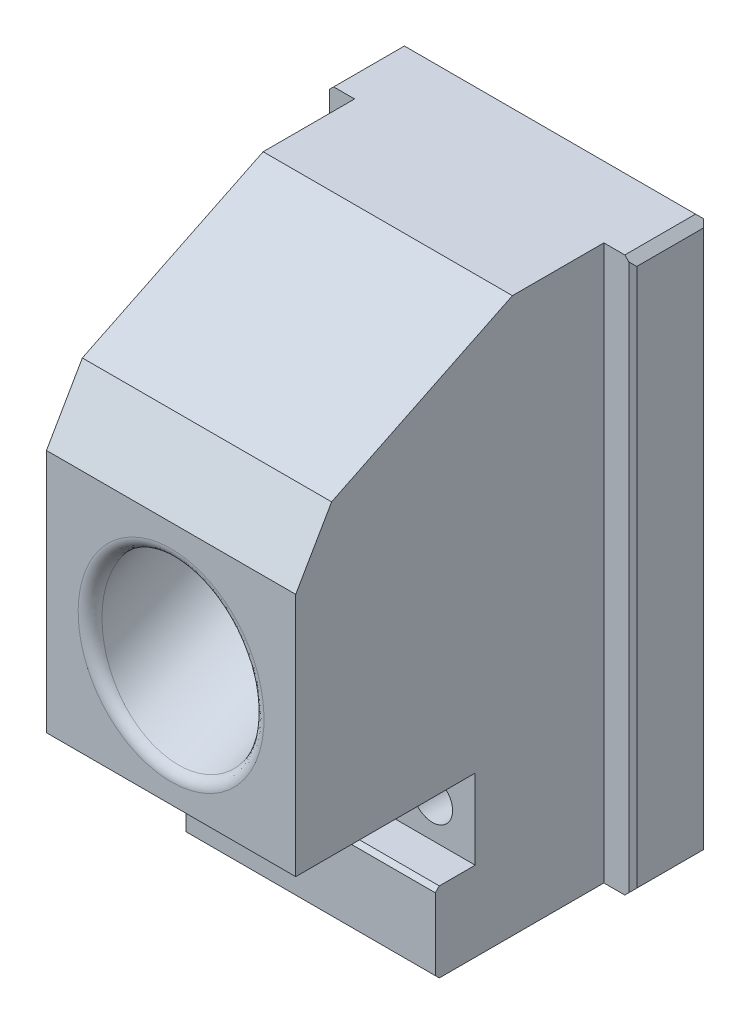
ISO-10303-21;
HEADER;
FILE_DESCRIPTION(('STEP AP214'),'2;1');
FILE_NAME('part.step','',(''),(''),'','','');
FILE_SCHEMA(('AUTOMOTIVE_DESIGN { 1 0 10303 214 1 1 1 1 }'));
ENDSEC;
DATA;
#1=APPLICATION_CONTEXT('core data for automotive mechanical design processes');
#2=APPLICATION_PROTOCOL_DEFINITION('international standard','automotive_design',2000,#1);
#3=PRODUCT_CONTEXT('',#1,'mechanical');
#4=PRODUCT('Part','Part','',(#3));
#5=PRODUCT_RELATED_PRODUCT_CATEGORY('part','',(#4));
#6=PRODUCT_DEFINITION_FORMATION('','',#4);
#7=PRODUCT_DEFINITION_CONTEXT('part definition',#1,'design');
#8=PRODUCT_DEFINITION('design','',#6,#7);
#9=PRODUCT_DEFINITION_SHAPE('','',#8);
#10=(LENGTH_UNIT() NAMED_UNIT(*) SI_UNIT(.MILLI.,.METRE.));
#11=(NAMED_UNIT(*) PLANE_ANGLE_UNIT() SI_UNIT($,.RADIAN.));
#12=(NAMED_UNIT(*) SI_UNIT($,.STERADIAN.) SOLID_ANGLE_UNIT());
#13=UNCERTAINTY_MEASURE_WITH_UNIT(LENGTH_MEASURE(1.E-05),#10,'distance_accuracy_value','');
#14=(GEOMETRIC_REPRESENTATION_CONTEXT(3) GLOBAL_UNCERTAINTY_ASSIGNED_CONTEXT((#13)) GLOBAL_UNIT_ASSIGNED_CONTEXT((#10,
#11,#12)) REPRESENTATION_CONTEXT('',''));
#15=CARTESIAN_POINT('',(0.,0.,0.));
#16=DIRECTION('',(0.,0.,1.));
#17=DIRECTION('',(1.,0.,0.));
#18=AXIS2_PLACEMENT_3D('',#15,#16,#17);
#19=CARTESIAN_POINT('',(94.1229412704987,10.16,-11.43));
#20=DIRECTION('',(0.,0.,-1.));
#21=DIRECTION('',(-1.,0.,0.));
#22=AXIS2_PLACEMENT_3D('',#19,#20,#21);
#23=PLANE('',#22);
#24=DIRECTION('',(0.999999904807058,-0.000436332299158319,0.));
#25=VECTOR('',#24,1.);
#26=CARTESIAN_POINT('',(-3.6195001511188,7.36530732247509,-11.43));
#27=LINE('',#26,#25);
#28=CARTESIAN_POINT('',(-3.61924615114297,7.36530721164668,-11.43));
#29=VERTEX_POINT('',#28);
#30=CARTESIAN_POINT('',(-3.6195001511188,7.36530732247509,-11.43));
#31=VERTEX_POINT('',#30);
#32=EDGE_CURVE('E371',#29,#31,#27,.F.);
#33=ORIENTED_EDGE('',*,*,#32,.F.);
#34=CARTESIAN_POINT('',(-5.207,7.366,-11.43));
#35=DIRECTION('',(0.,0.,1.));
#36=DIRECTION('',(1.,0.,0.));
#37=AXIS2_PLACEMENT_3D('',#34,#35,#36);
#38=CIRCLE('',#37,1.587754);
#39=CARTESIAN_POINT('',(-3.619246,7.366,-11.43));
#40=VERTEX_POINT('',#39);
#41=EDGE_CURVE('E323',#40,#29,#38,.T.);
#42=ORIENTED_EDGE('',*,*,#41,.F.);
#43=DIRECTION('',(1.,0.,0.));
#44=VECTOR('',#43,1.);
#45=CARTESIAN_POINT('',(-3.6195,7.366,-11.43));
#46=LINE('',#45,#44);
#47=CARTESIAN_POINT('',(-3.6195,7.366,-11.43));
#48=VERTEX_POINT('',#47);
#49=EDGE_CURVE('E62',#40,#48,#46,.F.);
#50=ORIENTED_EDGE('',*,*,#49,.T.);
#51=CARTESIAN_POINT('',(-5.207,7.366,-11.43));
#52=DIRECTION('',(0.,0.,1.));
#53=DIRECTION('',(1.,0.,0.));
#54=AXIS2_PLACEMENT_3D('',#51,#52,#53);
#55=CIRCLE('',#54,1.5875);
#56=EDGE_CURVE('E352',#48,#31,#55,.T.);
#57=ORIENTED_EDGE('',*,*,#56,.T.);
#58=EDGE_LOOP('',(#33,#42,#50,#57));
#59=FACE_BOUND('',#58,.T.);
#60=CARTESIAN_POINT('',(-5.207,7.366,-11.43));
#61=DIRECTION('',(0.,0.,-1.));
#62=DIRECTION('',(-1.,0.,0.));
#63=AXIS2_PLACEMENT_3D('',#60,#61,#62);
#64=CIRCLE('',#63,1.28905);
#65=CARTESIAN_POINT('',(-6.49605,7.366,-11.43));
#66=VERTEX_POINT('',#65);
#67=EDGE_CURVE('E374',#66,#66,#64,.T.);
#68=ORIENTED_EDGE('',*,*,#67,.T.);
#69=EDGE_LOOP('',(#68));
#70=FACE_BOUND('',#69,.T.);
#71=CARTESIAN_POINT('',(5.207,7.366,-11.43));
#72=DIRECTION('',(0.,0.,-1.));
#73=DIRECTION('',(-1.,0.,0.));
#74=AXIS2_PLACEMENT_3D('',#71,#72,#73);
#75=CIRCLE('',#74,1.28905);
#76=CARTESIAN_POINT('',(3.91795,7.366,-11.43));
#77=VERTEX_POINT('',#76);
#78=EDGE_CURVE('E378',#77,#77,#75,.T.);
#79=ORIENTED_EDGE('',*,*,#78,.T.);
#80=EDGE_LOOP('',(#79));
#81=FACE_BOUND('',#80,.T.);
#82=DIRECTION('',(-1.,0.,0.));
#83=VECTOR('',#82,1.);
#84=CARTESIAN_POINT('',(94.1229412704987,10.16,-11.43));
#85=LINE('',#84,#83);
#86=CARTESIAN_POINT('',(7.9375,10.16,-11.43));
#87=VERTEX_POINT('',#86);
#88=CARTESIAN_POINT('',(-7.9375,10.16,-11.43));
#89=VERTEX_POINT('',#88);
#90=EDGE_CURVE('E389',#87,#89,#85,.T.);
#91=ORIENTED_EDGE('',*,*,#90,.T.);
#92=DIRECTION('',(0.,-1.,0.));
#93=VECTOR('',#92,1.);
#94=CARTESIAN_POINT('',(-7.9375,35.306,-11.43));
#95=LINE('',#94,#93);
#96=CARTESIAN_POINT('',(-7.9375,5.08,-11.43));
#97=VERTEX_POINT('',#96);
#98=EDGE_CURVE('E410',#89,#97,#95,.T.);
#99=ORIENTED_EDGE('',*,*,#98,.T.);
#100=DIRECTION('',(-1.,0.,0.));
#101=VECTOR('',#100,1.);
#102=CARTESIAN_POINT('',(94.1229412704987,5.08,-11.43));
#103=LINE('',#102,#101);
#104=CARTESIAN_POINT('',(7.9375,5.08,-11.43));
#105=VERTEX_POINT('',#104);
#106=EDGE_CURVE('E384',#105,#97,#103,.T.);
#107=ORIENTED_EDGE('',*,*,#106,.F.);
#108=DIRECTION('',(0.,1.,0.));
#109=VECTOR('',#108,1.);
#110=CARTESIAN_POINT('',(7.9375,35.306,-11.43));
#111=LINE('',#110,#109);
#112=EDGE_CURVE('E439',#105,#87,#111,.T.);
#113=ORIENTED_EDGE('',*,*,#112,.T.);
#114=EDGE_LOOP('',(#91,#99,#107,#113));
#115=FACE_BOUND('',#114,.T.);
#116=DIRECTION('',(0.999999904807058,-0.000436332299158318,0.));
#117=VECTOR('',#116,1.);
#118=CARTESIAN_POINT('',(6.7944998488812,7.36530732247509,-11.43));
#119=LINE('',#118,#117);
#120=CARTESIAN_POINT('',(6.79475384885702,7.36530721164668,-11.43));
#121=VERTEX_POINT('',#120);
#122=CARTESIAN_POINT('',(6.7944998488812,7.36530732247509,-11.43));
#123=VERTEX_POINT('',#122);
#124=EDGE_CURVE('E314',#121,#123,#119,.F.);
#125=ORIENTED_EDGE('',*,*,#124,.F.);
#126=CARTESIAN_POINT('',(5.207,7.366,-11.43));
#127=DIRECTION('',(0.,0.,1.));
#128=DIRECTION('',(1.,0.,0.));
#129=AXIS2_PLACEMENT_3D('',#126,#127,#128);
#130=CIRCLE('',#129,1.587754);
#131=CARTESIAN_POINT('',(6.794754,7.366,-11.43));
#132=VERTEX_POINT('',#131);
#133=EDGE_CURVE('E1268',#132,#121,#130,.T.);
#134=ORIENTED_EDGE('',*,*,#133,.F.);
#135=DIRECTION('',(1.,0.,0.));
#136=VECTOR('',#135,1.);
#137=CARTESIAN_POINT('',(6.7945,7.366,-11.43));
#138=LINE('',#137,#136);
#139=CARTESIAN_POINT('',(6.7945,7.366,-11.43));
#140=VERTEX_POINT('',#139);
#141=EDGE_CURVE('E54',#132,#140,#138,.F.);
#142=ORIENTED_EDGE('',*,*,#141,.T.);
#143=CARTESIAN_POINT('',(5.207,7.366,-11.43));
#144=DIRECTION('',(0.,0.,1.));
#145=DIRECTION('',(1.,0.,0.));
#146=AXIS2_PLACEMENT_3D('',#143,#144,#145);
#147=CIRCLE('',#146,1.5875);
#148=EDGE_CURVE('E1281',#140,#123,#147,.T.);
#149=ORIENTED_EDGE('',*,*,#148,.T.);
#150=EDGE_LOOP('',(#125,#134,#142,#149));
#151=FACE_BOUND('',#150,.T.);
#152=ADVANCED_FACE('F39',(#59,#70,#81,#115,#151),#23,.F.);
#153=CARTESIAN_POINT('',(7.9375,35.306,-19.6088));
#154=DIRECTION('',(0.,-1.,0.));
#155=DIRECTION('',(0.,0.,-1.));
#156=AXIS2_PLACEMENT_3D('',#153,#154,#155);
#157=PLANE('',#156);
#158=DIRECTION('',(-1.,0.,0.));
#159=VECTOR('',#158,1.);
#160=CARTESIAN_POINT('',(7.9375,35.306,-19.62404));
#161=LINE('',#160,#159);
#162=CARTESIAN_POINT('',(9.271,35.306,-19.62404));
#163=VERTEX_POINT('',#162);
#164=CARTESIAN_POINT('',(7.9375,35.306,-19.62404));
#165=VERTEX_POINT('',#164);
#166=EDGE_CURVE('E449',#163,#165,#161,.T.);
#167=ORIENTED_EDGE('',*,*,#166,.F.);
#168=DIRECTION('',(0.,0.,-1.));
#169=VECTOR('',#168,1.);
#170=CARTESIAN_POINT('',(9.271,35.306,-24.13));
#171=LINE('',#170,#169);
#172=CARTESIAN_POINT('',(9.271,35.306,-24.13));
#173=VERTEX_POINT('',#172);
#174=EDGE_CURVE('E644',#163,#173,#171,.T.);
#175=ORIENTED_EDGE('',*,*,#174,.T.);
#176=DIRECTION('',(-1.,0.,0.));
#177=VECTOR('',#176,1.);
#178=CARTESIAN_POINT('',(-9.779,35.306,-24.13));
#179=LINE('',#178,#177);
#180=CARTESIAN_POINT('',(-9.271,35.306,-24.13));
#181=VERTEX_POINT('',#180);
#182=EDGE_CURVE('E673',#173,#181,#179,.T.);
#183=ORIENTED_EDGE('',*,*,#182,.T.);
#184=DIRECTION('',(0.,0.,1.));
#185=VECTOR('',#184,1.);
#186=CARTESIAN_POINT('',(-9.271,35.306,-19.62404));
#187=LINE('',#186,#185);
#188=CARTESIAN_POINT('',(-9.271,35.306,-19.62404));
#189=VERTEX_POINT('',#188);
#190=EDGE_CURVE('E642',#181,#189,#187,.T.);
#191=ORIENTED_EDGE('',*,*,#190,.T.);
#192=DIRECTION('',(-1.,0.,0.));
#193=VECTOR('',#192,1.);
#194=CARTESIAN_POINT('',(7.9375,35.306,-19.62404));
#195=LINE('',#194,#193);
#196=CARTESIAN_POINT('',(-7.9375,35.306,-19.62404));
#197=VERTEX_POINT('',#196);
#198=EDGE_CURVE('E424',#197,#189,#195,.T.);
#199=ORIENTED_EDGE('',*,*,#198,.F.);
#200=DIRECTION('',(0.,0.,-1.));
#201=VECTOR('',#200,1.);
#202=CARTESIAN_POINT('',(-7.9375,35.306,0.));
#203=LINE('',#202,#201);
#204=CARTESIAN_POINT('',(-7.9375,35.306,-13.7994304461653));
#205=VERTEX_POINT('',#204);
#206=EDGE_CURVE('E422',#205,#197,#203,.T.);
#207=ORIENTED_EDGE('',*,*,#206,.F.);
#208=DIRECTION('',(-1.,0.,0.));
#209=VECTOR('',#208,1.);
#210=CARTESIAN_POINT('',(94.1229412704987,35.306,-13.7994304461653));
#211=LINE('',#210,#209);
#212=CARTESIAN_POINT('',(7.9375,35.306,-13.7994304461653));
#213=VERTEX_POINT('',#212);
#214=EDGE_CURVE('E395',#213,#205,#211,.T.);
#215=ORIENTED_EDGE('',*,*,#214,.F.);
#216=DIRECTION('',(0.,0.,1.));
#217=VECTOR('',#216,1.);
#218=CARTESIAN_POINT('',(7.9375,35.306,-19.6088));
#219=LINE('',#218,#217);
#220=EDGE_CURVE('E425',#165,#213,#219,.T.);
#221=ORIENTED_EDGE('',*,*,#220,.F.);
#222=EDGE_LOOP('',(#167,#175,#183,#191,#199,#207,#215,#221));
#223=FACE_BOUND('',#222,.T.);
#224=ADVANCED_FACE('F499',(#223),#157,.F.);
#225=CARTESIAN_POINT('',(7.9375,0.,-19.6088));
#226=DIRECTION('',(0.,-1.,0.));
#227=DIRECTION('',(0.,0.,-1.));
#228=AXIS2_PLACEMENT_3D('',#225,#226,#227);
#229=PLANE('',#228);
#230=DIRECTION('',(-1.,0.,0.));
#231=VECTOR('',#230,1.);
#232=CARTESIAN_POINT('',(7.9375,0.,-19.62404));
#233=LINE('',#232,#231);
#234=CARTESIAN_POINT('',(-7.9375,0.,-19.62404));
#235=VERTEX_POINT('',#234);
#236=CARTESIAN_POINT('',(-9.271,0.,-19.62404));
#237=VERTEX_POINT('',#236);
#238=EDGE_CURVE('E419',#235,#237,#233,.T.);
#239=ORIENTED_EDGE('',*,*,#238,.T.);
#240=DIRECTION('',(0.,0.,-1.));
#241=VECTOR('',#240,1.);
#242=CARTESIAN_POINT('',(-9.271,0.,-19.6088));
#243=LINE('',#242,#241);
#244=CARTESIAN_POINT('',(-9.271,0.,-24.13));
#245=VERTEX_POINT('',#244);
#246=EDGE_CURVE('E709',#237,#245,#243,.T.);
#247=ORIENTED_EDGE('',*,*,#246,.T.);
#248=DIRECTION('',(1.,0.,0.));
#249=VECTOR('',#248,1.);
#250=CARTESIAN_POINT('',(7.9375,0.,-24.13));
#251=LINE('',#250,#249);
#252=CARTESIAN_POINT('',(9.271,0.,-24.13));
#253=VERTEX_POINT('',#252);
#254=EDGE_CURVE('E689',#245,#253,#251,.T.);
#255=ORIENTED_EDGE('',*,*,#254,.T.);
#256=DIRECTION('',(0.,0.,1.));
#257=VECTOR('',#256,1.);
#258=CARTESIAN_POINT('',(9.271,0.,-19.6088));
#259=LINE('',#258,#257);
#260=CARTESIAN_POINT('',(9.271,0.,-19.62404));
#261=VERTEX_POINT('',#260);
#262=EDGE_CURVE('E707',#253,#261,#259,.T.);
#263=ORIENTED_EDGE('',*,*,#262,.T.);
#264=DIRECTION('',(-1.,0.,0.));
#265=VECTOR('',#264,1.);
#266=CARTESIAN_POINT('',(7.9375,0.,-19.62404));
#267=LINE('',#266,#265);
#268=CARTESIAN_POINT('',(7.9375,0.,-19.62404));
#269=VERTEX_POINT('',#268);
#270=EDGE_CURVE('E428',#261,#269,#267,.T.);
#271=ORIENTED_EDGE('',*,*,#270,.T.);
#272=DIRECTION('',(0.,0.,1.));
#273=VECTOR('',#272,1.);
#274=CARTESIAN_POINT('',(7.9375,0.,-19.6088));
#275=LINE('',#274,#273);
#276=CARTESIAN_POINT('',(7.9375,0.,-9.144));
#277=VERTEX_POINT('',#276);
#278=EDGE_CURVE('E416',#269,#277,#275,.T.);
#279=ORIENTED_EDGE('',*,*,#278,.T.);
#280=DIRECTION('',(-1.,0.,0.));
#281=VECTOR('',#280,1.);
#282=CARTESIAN_POINT('',(-7.9375,0.,-9.144));
#283=LINE('',#282,#281);
#284=CARTESIAN_POINT('',(-7.9375,0.,-9.144));
#285=VERTEX_POINT('',#284);
#286=EDGE_CURVE('E686',#277,#285,#283,.T.);
#287=ORIENTED_EDGE('',*,*,#286,.T.);
#288=DIRECTION('',(0.,0.,-1.));
#289=VECTOR('',#288,1.);
#290=CARTESIAN_POINT('',(-7.9375,0.,0.));
#291=LINE('',#290,#289);
#292=EDGE_CURVE('E417',#285,#235,#291,.T.);
#293=ORIENTED_EDGE('',*,*,#292,.T.);
#294=EDGE_LOOP('',(#239,#247,#255,#263,#271,#279,#287,#293));
#295=FACE_BOUND('',#294,.T.);
#296=ADVANCED_FACE('F507',(#295),#229,.T.);
#297=CARTESIAN_POINT('',(-7.9375,35.306,0.));
#298=DIRECTION('',(-1.,0.,0.));
#299=DIRECTION('',(0.,0.,1.));
#300=AXIS2_PLACEMENT_3D('',#297,#298,#299);
#301=PLANE('',#300);
#302=ORIENTED_EDGE('',*,*,#292,.F.);
#303=DIRECTION('',(0.,0.707106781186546,0.707106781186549));
#304=VECTOR('',#303,1.);
#305=CARTESIAN_POINT('',(-7.9375,22.225,13.081));
#306=LINE('',#305,#304);
#307=CARTESIAN_POINT('',(-7.9375,0.254,-8.89));
#308=VERTEX_POINT('',#307);
#309=EDGE_CURVE('E694',#285,#308,#306,.T.);
#310=ORIENTED_EDGE('',*,*,#309,.T.);
#311=DIRECTION('',(0.,-1.,0.));
#312=VECTOR('',#311,1.);
#313=CARTESIAN_POINT('',(-7.9375,35.306,-8.89));
#314=LINE('',#313,#312);
#315=CARTESIAN_POINT('',(-7.9375,4.826,-8.89));
#316=VERTEX_POINT('',#315);
#317=EDGE_CURVE('E404',#316,#308,#314,.T.);
#318=ORIENTED_EDGE('',*,*,#317,.F.);
#319=DIRECTION('',(0.,-0.707106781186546,0.707106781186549));
#320=VECTOR('',#319,1.);
#321=CARTESIAN_POINT('',(-7.9375,15.621,-19.685));
#322=LINE('',#321,#320);
#323=CARTESIAN_POINT('',(-7.9375,5.08,-9.144));
#324=VERTEX_POINT('',#323);
#325=EDGE_CURVE('E692',#316,#324,#322,.F.);
#326=ORIENTED_EDGE('',*,*,#325,.T.);
#327=DIRECTION('',(0.,0.,1.));
#328=VECTOR('',#327,1.);
#329=CARTESIAN_POINT('',(-7.9375,5.08,0.));
#330=LINE('',#329,#328);
#331=EDGE_CURVE('E407',#97,#324,#330,.T.);
#332=ORIENTED_EDGE('',*,*,#331,.F.);
#333=ORIENTED_EDGE('',*,*,#98,.F.);
#334=DIRECTION('',(0.,0.,-1.));
#335=VECTOR('',#334,1.);
#336=CARTESIAN_POINT('',(-7.9375,10.16,0.));
#337=LINE('',#336,#335);
#338=CARTESIAN_POINT('',(-7.9375,10.16,0.));
#339=VERTEX_POINT('',#338);
#340=EDGE_CURVE('E401',#339,#89,#337,.T.);
#341=ORIENTED_EDGE('',*,*,#340,.F.);
#342=DIRECTION('',(0.,-1.,0.));
#343=VECTOR('',#342,1.);
#344=CARTESIAN_POINT('',(-7.9375,35.306,0.));
#345=LINE('',#344,#343);
#346=CARTESIAN_POINT('',(-7.9375,25.7314700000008,0.));
#347=VERTEX_POINT('',#346);
#348=EDGE_CURVE('E429',#347,#339,#345,.T.);
#349=ORIENTED_EDGE('',*,*,#348,.F.);
#350=DIRECTION('',(0.,0.866025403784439,-0.5));
#351=VECTOR('',#350,1.);
#352=CARTESIAN_POINT('',(-7.9375,32.9123675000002,-4.14589310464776));
#353=LINE('',#352,#351);
#354=CARTESIAN_POINT('',(-7.9375,29.6903627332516,-2.28566778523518));
#355=VERTEX_POINT('',#354);
#356=EDGE_CURVE('E739',#347,#355,#353,.T.);
#357=ORIENTED_EDGE('',*,*,#356,.T.);
#358=DIRECTION('',(0.,-0.438371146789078,0.898794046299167));
#359=VECTOR('',#358,1.);
#360=CARTESIAN_POINT('',(-7.9375,29.8689502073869,-2.65182636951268));
#361=LINE('',#360,#359);
#362=EDGE_CURVE('E413',#205,#355,#361,.T.);
#363=ORIENTED_EDGE('',*,*,#362,.F.);
#364=ORIENTED_EDGE('',*,*,#206,.T.);
#365=DIRECTION('',(0.,-1.,0.));
#366=VECTOR('',#365,1.);
#367=CARTESIAN_POINT('',(-7.9375,35.306,-19.62404));
#368=LINE('',#367,#366);
#369=EDGE_CURVE('E432',#197,#235,#368,.T.);
#370=ORIENTED_EDGE('',*,*,#369,.T.);
#371=EDGE_LOOP('',(#302,#310,#318,#326,#332,#333,#341,#349,#357,#363,#364,#370));
#372=FACE_BOUND('',#371,.T.);
#373=ADVANCED_FACE('F523',(#372),#301,.T.);
#374=CARTESIAN_POINT('',(7.9375,35.306,-19.6088));
#375=DIRECTION('',(1.,0.,0.));
#376=DIRECTION('',(0.,0.,-1.));
#377=AXIS2_PLACEMENT_3D('',#374,#375,#376);
#378=PLANE('',#377);
#379=DIRECTION('',(0.,1.,0.));
#380=VECTOR('',#379,1.);
#381=CARTESIAN_POINT('',(7.9375,35.306,-8.89));
#382=LINE('',#381,#380);
#383=CARTESIAN_POINT('',(7.9375,0.254,-8.89));
#384=VERTEX_POINT('',#383);
#385=CARTESIAN_POINT('',(7.9375,4.826,-8.89));
#386=VERTEX_POINT('',#385);
#387=EDGE_CURVE('E434',#384,#386,#382,.T.);
#388=ORIENTED_EDGE('',*,*,#387,.F.);
#389=DIRECTION('',(0.,-0.707106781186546,-0.707106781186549));
#390=VECTOR('',#389,1.);
#391=CARTESIAN_POINT('',(7.9375,12.4206,3.2766));
#392=LINE('',#391,#390);
#393=EDGE_CURVE('E702',#384,#277,#392,.T.);
#394=ORIENTED_EDGE('',*,*,#393,.T.);
#395=ORIENTED_EDGE('',*,*,#278,.F.);
#396=DIRECTION('',(0.,-1.,0.));
#397=VECTOR('',#396,1.);
#398=CARTESIAN_POINT('',(7.9375,35.306,-19.62404));
#399=LINE('',#398,#397);
#400=EDGE_CURVE('E452',#165,#269,#399,.T.);
#401=ORIENTED_EDGE('',*,*,#400,.F.);
#402=ORIENTED_EDGE('',*,*,#220,.T.);
#403=DIRECTION('',(0.,0.438371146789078,-0.898794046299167));
#404=VECTOR('',#403,1.);
#405=CARTESIAN_POINT('',(7.9375,37.5949228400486,-18.4924177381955));
#406=LINE('',#405,#404);
#407=CARTESIAN_POINT('',(7.9375,29.6903627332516,-2.28566778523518));
#408=VERTEX_POINT('',#407);
#409=EDGE_CURVE('E442',#408,#213,#406,.T.);
#410=ORIENTED_EDGE('',*,*,#409,.F.);
#411=DIRECTION('',(0.,-0.866025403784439,0.5));
#412=VECTOR('',#411,1.);
#413=CARTESIAN_POINT('',(7.9375,41.4032269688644,-9.04809310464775));
#414=LINE('',#413,#412);
#415=CARTESIAN_POINT('',(7.9375,25.7314700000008,0.));
#416=VERTEX_POINT('',#415);
#417=EDGE_CURVE('E677',#408,#416,#414,.T.);
#418=ORIENTED_EDGE('',*,*,#417,.T.);
#419=DIRECTION('',(0.,-1.,0.));
#420=VECTOR('',#419,1.);
#421=CARTESIAN_POINT('',(7.9375,35.306,0.));
#422=LINE('',#421,#420);
#423=CARTESIAN_POINT('',(7.9375,10.16,0.));
#424=VERTEX_POINT('',#423);
#425=EDGE_CURVE('E431',#416,#424,#422,.T.);
#426=ORIENTED_EDGE('',*,*,#425,.T.);
#427=DIRECTION('',(0.,0.,1.));
#428=VECTOR('',#427,1.);
#429=CARTESIAN_POINT('',(7.9375,10.16,-19.6088));
#430=LINE('',#429,#428);
#431=EDGE_CURVE('E398',#87,#424,#430,.T.);
#432=ORIENTED_EDGE('',*,*,#431,.F.);
#433=ORIENTED_EDGE('',*,*,#112,.F.);
#434=DIRECTION('',(0.,0.,-1.));
#435=VECTOR('',#434,1.);
#436=CARTESIAN_POINT('',(7.9375,5.08,-19.6088));
#437=LINE('',#436,#435);
#438=CARTESIAN_POINT('',(7.9375,5.08,-9.144));
#439=VERTEX_POINT('',#438);
#440=EDGE_CURVE('E437',#439,#105,#437,.T.);
#441=ORIENTED_EDGE('',*,*,#440,.F.);
#442=DIRECTION('',(0.,0.707106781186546,-0.707106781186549));
#443=VECTOR('',#442,1.);
#444=CARTESIAN_POINT('',(7.9375,25.4254,-29.4894));
#445=LINE('',#444,#443);
#446=EDGE_CURVE('E700',#439,#386,#445,.F.);
#447=ORIENTED_EDGE('',*,*,#446,.T.);
#448=EDGE_LOOP('',(#388,#394,#395,#401,#402,#410,#418,#426,#432,#433,#441,#447));
#449=FACE_BOUND('',#448,.T.);
#450=ADVANCED_FACE('F542',(#449),#378,.T.);
#451=CARTESIAN_POINT('',(7.9375,35.306,0.));
#452=DIRECTION('',(0.,0.,1.));
#453=DIRECTION('',(1.,0.,0.));
#454=AXIS2_PLACEMENT_3D('',#451,#452,#453);
#455=PLANE('',#454);
#456=CARTESIAN_POINT('',(0.,17.8494435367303,0.));
#457=DIRECTION('',(0.,0.,1.));
#458=DIRECTION('',(0.,-1.,0.));
#459=AXIS2_PLACEMENT_3D('',#456,#457,#458);
#460=ELLIPSE('',#459,6.42929798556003,5.9182);
#461=CARTESIAN_POINT('',(0.,11.4201455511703,0.));
#462=VERTEX_POINT('',#461);
#463=EDGE_CURVE('E463',#462,#462,#460,.F.);
#464=ORIENTED_EDGE('',*,*,#463,.T.);
#465=EDGE_LOOP('',(#464));
#466=FACE_BOUND('',#465,.T.);
#467=ORIENTED_EDGE('',*,*,#425,.F.);
#468=DIRECTION('',(-1.,0.,0.));
#469=VECTOR('',#468,1.);
#470=CARTESIAN_POINT('',(-7.9375,25.7314700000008,0.));
#471=LINE('',#470,#469);
#472=EDGE_CURVE('E466',#416,#347,#471,.T.);
#473=ORIENTED_EDGE('',*,*,#472,.T.);
#474=ORIENTED_EDGE('',*,*,#348,.T.);
#475=DIRECTION('',(-1.,0.,0.));
#476=VECTOR('',#475,1.);
#477=CARTESIAN_POINT('',(94.1229412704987,10.16,0.));
#478=LINE('',#477,#476);
#479=EDGE_CURVE('E392',#424,#339,#478,.T.);
#480=ORIENTED_EDGE('',*,*,#479,.F.);
#481=EDGE_LOOP('',(#467,#473,#474,#480));
#482=FACE_BOUND('',#481,.T.);
#483=ADVANCED_FACE('F544',(#466,#482),#455,.T.);
#484=CARTESIAN_POINT('',(-7.9375,35.306,-19.62404));
#485=DIRECTION('',(0.,0.,1.));
#486=DIRECTION('',(1.,0.,0.));
#487=AXIS2_PLACEMENT_3D('',#484,#485,#486);
#488=PLANE('',#487);
#489=DIRECTION('',(-0.707106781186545,-0.70710678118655,0.));
#490=VECTOR('',#489,1.);
#491=CARTESIAN_POINT('',(-8.60425,35.97275,-19.62404));
#492=LINE('',#491,#490);
#493=CARTESIAN_POINT('',(-9.525,35.052,-19.62404));
#494=VERTEX_POINT('',#493);
#495=EDGE_CURVE('E628',#189,#494,#492,.T.);
#496=ORIENTED_EDGE('',*,*,#495,.T.);
#497=DIRECTION('',(0.,-1.,0.));
#498=VECTOR('',#497,1.);
#499=CARTESIAN_POINT('',(-9.525,35.306,-19.62404));
#500=LINE('',#499,#498);
#501=CARTESIAN_POINT('',(-9.525,0.254,-19.62404));
#502=VERTEX_POINT('',#501);
#503=EDGE_CURVE('E11',#494,#502,#500,.T.);
#504=ORIENTED_EDGE('',*,*,#503,.T.);
#505=DIRECTION('',(-0.707106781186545,0.70710678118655,0.));
#506=VECTOR('',#505,1.);
#507=CARTESIAN_POINT('',(-26.25725,16.98625,-19.62404));
#508=LINE('',#507,#506);
#509=EDGE_CURVE('E631',#502,#237,#508,.F.);
#510=ORIENTED_EDGE('',*,*,#509,.T.);
#511=ORIENTED_EDGE('',*,*,#238,.F.);
#512=ORIENTED_EDGE('',*,*,#369,.F.);
#513=ORIENTED_EDGE('',*,*,#198,.T.);
#514=EDGE_LOOP('',(#496,#504,#510,#511,#512,#513));
#515=FACE_BOUND('',#514,.T.);
#516=ADVANCED_FACE('F538',(#515),#488,.T.);
#517=CARTESIAN_POINT('',(-9.779,35.306,-19.6088));
#518=DIRECTION('',(-1.,0.,0.));
#519=DIRECTION('',(0.,0.,1.));
#520=AXIS2_PLACEMENT_3D('',#517,#518,#519);
#521=PLANE('',#520);
#522=DIRECTION('',(0.,-1.,0.));
#523=VECTOR('',#522,1.);
#524=CARTESIAN_POINT('',(-9.779,35.306,-24.13));
#525=LINE('',#524,#523);
#526=CARTESIAN_POINT('',(-9.779,34.798,-24.13));
#527=VERTEX_POINT('',#526);
#528=CARTESIAN_POINT('',(-9.779,0.508,-24.13));
#529=VERTEX_POINT('',#528);
#530=EDGE_CURVE('E596',#527,#529,#525,.T.);
#531=ORIENTED_EDGE('',*,*,#530,.T.);
#532=DIRECTION('',(0.,0.,1.));
#533=VECTOR('',#532,1.);
#534=CARTESIAN_POINT('',(-9.779,0.508,-19.6088));
#535=LINE('',#534,#533);
#536=CARTESIAN_POINT('',(-9.779,0.508,-19.87804));
#537=VERTEX_POINT('',#536);
#538=EDGE_CURVE('E619',#529,#537,#535,.T.);
#539=ORIENTED_EDGE('',*,*,#538,.T.);
#540=DIRECTION('',(0.,1.,0.));
#541=VECTOR('',#540,1.);
#542=CARTESIAN_POINT('',(-9.779,35.306,-19.87804));
#543=LINE('',#542,#541);
#544=CARTESIAN_POINT('',(-9.779,34.798,-19.87804));
#545=VERTEX_POINT('',#544);
#546=EDGE_CURVE('E594',#537,#545,#543,.T.);
#547=ORIENTED_EDGE('',*,*,#546,.T.);
#548=DIRECTION('',(0.,0.,-1.));
#549=VECTOR('',#548,1.);
#550=CARTESIAN_POINT('',(-9.779,34.798,-24.13));
#551=LINE('',#550,#549);
#552=EDGE_CURVE('E609',#545,#527,#551,.T.);
#553=ORIENTED_EDGE('',*,*,#552,.T.);
#554=EDGE_LOOP('',(#531,#539,#547,#553));
#555=FACE_BOUND('',#554,.T.);
#556=ADVANCED_FACE('F534',(#555),#521,.T.);
#557=CARTESIAN_POINT('',(-9.779,35.306,-24.384));
#558=DIRECTION('',(0.,0.,-1.));
#559=DIRECTION('',(-1.,0.,0.));
#560=AXIS2_PLACEMENT_3D('',#557,#558,#559);
#561=PLANE('',#560);
#562=DIRECTION('',(1.,0.,0.));
#563=VECTOR('',#562,1.);
#564=CARTESIAN_POINT('',(9.779,35.052,-24.384));
#565=LINE('',#564,#563);
#566=CARTESIAN_POINT('',(-9.525,35.052,-24.384));
#567=VERTEX_POINT('',#566);
#568=CARTESIAN_POINT('',(9.525,35.052,-24.384));
#569=VERTEX_POINT('',#568);
#570=EDGE_CURVE('E671',#567,#569,#565,.T.);
#571=ORIENTED_EDGE('',*,*,#570,.T.);
#572=DIRECTION('',(0.,-1.,0.));
#573=VECTOR('',#572,1.);
#574=CARTESIAN_POINT('',(9.525,35.306,-24.384));
#575=LINE('',#574,#573);
#576=CARTESIAN_POINT('',(9.525,0.254,-24.384));
#577=VERTEX_POINT('',#576);
#578=EDGE_CURVE('E591',#569,#577,#575,.T.);
#579=ORIENTED_EDGE('',*,*,#578,.T.);
#580=DIRECTION('',(-1.,0.,0.));
#581=VECTOR('',#580,1.);
#582=CARTESIAN_POINT('',(-9.779,0.254,-24.384));
#583=LINE('',#582,#581);
#584=CARTESIAN_POINT('',(-9.525,0.254,-24.384));
#585=VERTEX_POINT('',#584);
#586=EDGE_CURVE('E679',#577,#585,#583,.T.);
#587=ORIENTED_EDGE('',*,*,#586,.T.);
#588=DIRECTION('',(0.,1.,0.));
#589=VECTOR('',#588,1.);
#590=CARTESIAN_POINT('',(-9.525,35.306,-24.384));
#591=LINE('',#590,#589);
#592=EDGE_CURVE('E589',#585,#567,#591,.T.);
#593=ORIENTED_EDGE('',*,*,#592,.T.);
#594=EDGE_LOOP('',(#571,#579,#587,#593));
#595=FACE_BOUND('',#594,.T.);
#596=CARTESIAN_POINT('',(0.,27.5529378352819,-24.384));
#597=DIRECTION('',(0.,0.,-1.));
#598=DIRECTION('',(0.,-1.,0.));
#599=AXIS2_PLACEMENT_3D('',#596,#597,#598);
#600=ELLIPSE('',#599,6.42929798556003,5.9182);
#601=CARTESIAN_POINT('',(0.,21.1236398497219,-24.384));
#602=VERTEX_POINT('',#601);
#603=EDGE_CURVE('E460',#602,#602,#600,.F.);
#604=ORIENTED_EDGE('',*,*,#603,.T.);
#605=EDGE_LOOP('',(#604));
#606=FACE_BOUND('',#605,.T.);
#607=ADVANCED_FACE('F530',(#595,#606),#561,.T.);
#608=CARTESIAN_POINT('',(9.779,35.306,-24.384));
#609=DIRECTION('',(1.,0.,0.));
#610=DIRECTION('',(0.,0.,-1.));
#611=AXIS2_PLACEMENT_3D('',#608,#609,#610);
#612=PLANE('',#611);
#613=DIRECTION('',(0.,1.,0.));
#614=VECTOR('',#613,1.);
#615=CARTESIAN_POINT('',(9.779,35.306,-24.13));
#616=LINE('',#615,#614);
#617=CARTESIAN_POINT('',(9.779,0.508,-24.13));
#618=VERTEX_POINT('',#617);
#619=CARTESIAN_POINT('',(9.779,34.798,-24.13));
#620=VERTEX_POINT('',#619);
#621=EDGE_CURVE('E650',#618,#620,#616,.T.);
#622=ORIENTED_EDGE('',*,*,#621,.T.);
#623=DIRECTION('',(0.,0.,1.));
#624=VECTOR('',#623,1.);
#625=CARTESIAN_POINT('',(9.779,34.798,-19.62404));
#626=LINE('',#625,#624);
#627=CARTESIAN_POINT('',(9.779,34.798,-19.87804));
#628=VERTEX_POINT('',#627);
#629=EDGE_CURVE('E570',#620,#628,#626,.T.);
#630=ORIENTED_EDGE('',*,*,#629,.T.);
#631=DIRECTION('',(0.,-1.,0.));
#632=VECTOR('',#631,1.);
#633=CARTESIAN_POINT('',(9.779,35.306,-19.87804));
#634=LINE('',#633,#632);
#635=CARTESIAN_POINT('',(9.779,0.508,-19.87804));
#636=VERTEX_POINT('',#635);
#637=EDGE_CURVE('E652',#628,#636,#634,.T.);
#638=ORIENTED_EDGE('',*,*,#637,.T.);
#639=DIRECTION('',(0.,0.,-1.));
#640=VECTOR('',#639,1.);
#641=CARTESIAN_POINT('',(9.779,0.508,-24.384));
#642=LINE('',#641,#640);
#643=EDGE_CURVE('E639',#636,#618,#642,.T.);
#644=ORIENTED_EDGE('',*,*,#643,.T.);
#645=EDGE_LOOP('',(#622,#630,#638,#644));
#646=FACE_BOUND('',#645,.T.);
#647=ADVANCED_FACE('F526',(#646),#612,.T.);
#648=CARTESIAN_POINT('',(9.779,35.306,-19.62404));
#649=DIRECTION('',(0.,0.,1.));
#650=DIRECTION('',(1.,0.,0.));
#651=AXIS2_PLACEMENT_3D('',#648,#649,#650);
#652=PLANE('',#651);
#653=DIRECTION('',(-0.707106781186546,-0.707106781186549,0.));
#654=VECTOR('',#653,1.);
#655=CARTESIAN_POINT('',(27.178,17.907,-19.62404));
#656=LINE('',#655,#654);
#657=CARTESIAN_POINT('',(9.525,0.253999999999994,-19.62404));
#658=VERTEX_POINT('',#657);
#659=EDGE_CURVE('E563',#261,#658,#656,.F.);
#660=ORIENTED_EDGE('',*,*,#659,.T.);
#661=DIRECTION('',(0.,1.,0.));
#662=VECTOR('',#661,1.);
#663=CARTESIAN_POINT('',(9.525,35.306,-19.62404));
#664=LINE('',#663,#662);
#665=CARTESIAN_POINT('',(9.525,35.052,-19.62404));
#666=VERTEX_POINT('',#665);
#667=EDGE_CURVE('E565',#658,#666,#664,.T.);
#668=ORIENTED_EDGE('',*,*,#667,.T.);
#669=DIRECTION('',(-0.707106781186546,0.707106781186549,0.));
#670=VECTOR('',#669,1.);
#671=CARTESIAN_POINT('',(9.525,35.052,-19.62404));
#672=LINE('',#671,#670);
#673=EDGE_CURVE('E571',#666,#163,#672,.T.);
#674=ORIENTED_EDGE('',*,*,#673,.T.);
#675=ORIENTED_EDGE('',*,*,#166,.T.);
#676=ORIENTED_EDGE('',*,*,#400,.T.);
#677=ORIENTED_EDGE('',*,*,#270,.F.);
#678=EDGE_LOOP('',(#660,#668,#674,#675,#676,#677));
#679=FACE_BOUND('',#678,.T.);
#680=ADVANCED_FACE('F529',(#679),#652,.T.);
#681=CARTESIAN_POINT('',(94.1229412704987,5.08,-8.89));
#682=DIRECTION('',(0.,0.,-1.));
#683=DIRECTION('',(-1.,0.,0.));
#684=AXIS2_PLACEMENT_3D('',#681,#682,#683);
#685=PLANE('',#684);
#686=ORIENTED_EDGE('',*,*,#317,.T.);
#687=DIRECTION('',(1.,0.,0.));
#688=VECTOR('',#687,1.);
#689=CARTESIAN_POINT('',(7.9375,0.254,-8.89));
#690=LINE('',#689,#688);
#691=EDGE_CURVE('E698',#308,#384,#690,.T.);
#692=ORIENTED_EDGE('',*,*,#691,.T.);
#693=ORIENTED_EDGE('',*,*,#387,.T.);
#694=DIRECTION('',(-1.,0.,0.));
#695=VECTOR('',#694,1.);
#696=CARTESIAN_POINT('',(94.1229412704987,4.826,-8.89));
#697=LINE('',#696,#695);
#698=EDGE_CURVE('E696',#386,#316,#697,.T.);
#699=ORIENTED_EDGE('',*,*,#698,.T.);
#700=EDGE_LOOP('',(#686,#692,#693,#699));
#701=FACE_BOUND('',#700,.T.);
#702=ADVANCED_FACE('F554',(#701),#685,.F.);
#703=CARTESIAN_POINT('',(94.1229412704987,5.08,-11.43));
#704=DIRECTION('',(0.,-1.,0.));
#705=DIRECTION('',(0.,0.,-1.));
#706=AXIS2_PLACEMENT_3D('',#703,#704,#705);
#707=PLANE('',#706);
#708=ORIENTED_EDGE('',*,*,#331,.T.);
#709=DIRECTION('',(1.,0.,0.));
#710=VECTOR('',#709,1.);
#711=CARTESIAN_POINT('',(94.1229412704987,5.08,-9.144));
#712=LINE('',#711,#710);
#713=EDGE_CURVE('E704',#324,#439,#712,.T.);
#714=ORIENTED_EDGE('',*,*,#713,.T.);
#715=ORIENTED_EDGE('',*,*,#440,.T.);
#716=ORIENTED_EDGE('',*,*,#106,.T.);
#717=EDGE_LOOP('',(#708,#714,#715,#716));
#718=FACE_BOUND('',#717,.T.);
#719=ADVANCED_FACE('F514',(#718),#707,.F.);
#720=CARTESIAN_POINT('',(94.1229412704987,10.16,0.));
#721=DIRECTION('',(0.,1.,0.));
#722=DIRECTION('',(0.,0.,1.));
#723=AXIS2_PLACEMENT_3D('',#720,#721,#722);
#724=PLANE('',#723);
#725=ORIENTED_EDGE('',*,*,#479,.T.);
#726=ORIENTED_EDGE('',*,*,#340,.T.);
#727=ORIENTED_EDGE('',*,*,#90,.F.);
#728=ORIENTED_EDGE('',*,*,#431,.T.);
#729=EDGE_LOOP('',(#725,#726,#727,#728));
#730=FACE_BOUND('',#729,.T.);
#731=ADVANCED_FACE('F516',(#730),#724,.F.);
#732=CARTESIAN_POINT('',(94.1229412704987,35.306,-13.7994304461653));
#733=DIRECTION('',(0.,-0.898794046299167,-0.438371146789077));
#734=DIRECTION('',(0.,0.438371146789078,-0.898794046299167));
#735=AXIS2_PLACEMENT_3D('',#732,#733,#734);
#736=PLANE('',#735);
#737=ORIENTED_EDGE('',*,*,#362,.T.);
#738=DIRECTION('',(1.,0.,0.));
#739=VECTOR('',#738,1.);
#740=CARTESIAN_POINT('',(7.9375,29.6903627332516,-2.28566778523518));
#741=LINE('',#740,#739);
#742=EDGE_CURVE('E681',#355,#408,#741,.T.);
#743=ORIENTED_EDGE('',*,*,#742,.T.);
#744=ORIENTED_EDGE('',*,*,#409,.T.);
#745=ORIENTED_EDGE('',*,*,#214,.T.);
#746=EDGE_LOOP('',(#737,#743,#744,#745));
#747=FACE_BOUND('',#746,.T.);
#748=ADVANCED_FACE('F495',(#747),#736,.F.);
#749=CARTESIAN_POINT('',(0.,108.825108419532,-215.087235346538));
#750=DIRECTION('',(0.,-0.390731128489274,0.92050485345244));
#751=DIRECTION('',(0.,-0.92050485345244,-0.390731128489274));
#752=AXIS2_PLACEMENT_3D('',#749,#750,#751);
#753=CYLINDRICAL_SURFACE('',#752,5.1562);
#754=CARTESIAN_POINT('',(0.,27.5529378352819,-23.622));
#755=DIRECTION('',(0.,0.0519103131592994,0.998651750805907));
#756=DIRECTION('',(0.,-0.998651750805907,0.0519103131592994));
#757=AXIS2_PLACEMENT_3D('',#754,#755,#756);
#758=ELLIPSE('',#757,5.73560631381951,5.1562);
#759=CARTESIAN_POINT('',(0.,21.8250645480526,-23.3242628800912));
#760=VERTEX_POINT('',#759);
#761=EDGE_CURVE('E457',#760,#760,#758,.F.);
#762=ORIENTED_EDGE('',*,*,#761,.T.);
#763=EDGE_LOOP('',(#762));
#764=FACE_BOUND('',#763,.T.);
#765=CARTESIAN_POINT('',(0.,17.8494435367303,-0.762000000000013));
#766=DIRECTION('',(0.,-0.0519103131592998,-0.998651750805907));
#767=DIRECTION('',(0.,-0.998651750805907,0.0519103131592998));
#768=AXIS2_PLACEMENT_3D('',#765,#766,#767);
#769=ELLIPSE('',#768,5.7356063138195,5.1562);
#770=CARTESIAN_POINT('',(0.,12.1215702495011,-0.464262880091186));
#771=VERTEX_POINT('',#770);
#772=EDGE_CURVE('E444',#771,#771,#769,.F.);
#773=ORIENTED_EDGE('',*,*,#772,.T.);
#774=EDGE_LOOP('',(#773));
#775=FACE_BOUND('',#774,.T.);
#776=ADVANCED_FACE('F482',(#764,#775),#753,.F.);
#777=CARTESIAN_POINT('',(0.,21.1236398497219,-24.384));
#778=CARTESIAN_POINT('',(0.,22.2748962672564,-24.384));
#779=CARTESIAN_POINT('',(0.,21.8250645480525,-23.3242628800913));
#780=CARTESIAN_POINT('',(-0.258361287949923,21.1236398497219,-24.384));
#781=CARTESIAN_POINT('',(-0.203766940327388,22.2748962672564,-24.384));
#782=CARTESIAN_POINT('',(-0.225095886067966,21.8250645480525,-23.3242628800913));
#783=CARTESIAN_POINT('',(-0.516722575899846,21.1420648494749,-24.384));
#784=CARTESIAN_POINT('',(-0.407159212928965,22.2878284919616,-24.384));
#785=CARTESIAN_POINT('',(-0.450191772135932,21.8414794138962,-23.3251161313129));
#786=CARTESIAN_POINT('',(-1.02901425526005,21.215332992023,-24.384));
#787=CARTESIAN_POINT('',(-0.812967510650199,22.3398008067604,-24.384));
#788=CARTESIAN_POINT('',(-0.896523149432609,21.9067541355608,-23.3285091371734));
#789=CARTESIAN_POINT('',(-1.28292881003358,21.270286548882,-24.384));
#790=CARTESIAN_POINT('',(-1.01465787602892,22.3787321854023,-24.384));
#791=CARTESIAN_POINT('',(-1.1177448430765,21.9557123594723,-23.3310540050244));
#792=CARTESIAN_POINT('',(-1.78200566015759,21.4155608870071,-24.384));
#793=CARTESIAN_POINT('',(-1.41501596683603,22.4831219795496,-24.384));
#794=CARTESIAN_POINT('',(-1.55256287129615,22.0851375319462,-23.3377815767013));
#795=CARTESIAN_POINT('',(-2.02710838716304,21.5060857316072,-24.384));
#796=CARTESIAN_POINT('',(-1.61302634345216,22.5483739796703,-24.384));
#797=CARTESIAN_POINT('',(-1.76610730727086,22.1657862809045,-23.3419737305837));
#798=CARTESIAN_POINT('',(-2.50441817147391,21.7208658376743,-24.384));
#799=CARTESIAN_POINT('',(-2.00348014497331,22.7057739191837,-24.384));
#800=CARTESIAN_POINT('',(-2.1819608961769,22.3571342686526,-23.3519200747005));
#801=CARTESIAN_POINT('',(-2.73650418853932,21.8453893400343,-24.384));
#802=CARTESIAN_POINT('',(-2.1953716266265,22.7976378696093,-24.384));
#803=CARTESIAN_POINT('',(-2.3841645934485,22.4680724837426,-23.3576866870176));
#804=CARTESIAN_POINT('',(-3.1838747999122,22.1259822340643,-24.384));
#805=CARTESIAN_POINT('',(-2.5705145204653,23.0082995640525,-24.384));
#806=CARTESIAN_POINT('',(-2.7739338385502,22.7180532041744,-23.3706807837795));
#807=CARTESIAN_POINT('',(-3.39897268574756,22.2823484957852,-24.384));
#808=CARTESIAN_POINT('',(-2.75334576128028,23.1267617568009,-24.384));
#809=CARTESIAN_POINT('',(-2.96133671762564,22.8573601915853,-23.3779220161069));
#810=CARTESIAN_POINT('',(-3.80875228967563,22.6239353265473,-24.384));
#811=CARTESIAN_POINT('',(-3.10687581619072,23.3900752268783,-24.384));
#812=CARTESIAN_POINT('',(-3.31835499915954,23.1616805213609,-23.3937407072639));
#813=CARTESIAN_POINT('',(-4.00319086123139,22.8094468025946,-24.384));
#814=CARTESIAN_POINT('',(-3.27730083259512,23.5345675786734,-24.384));
#815=CARTESIAN_POINT('',(-3.48775856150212,23.3269530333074,-23.4023316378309));
#816=CARTESIAN_POINT('',(-4.36837757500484,23.2061682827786,-24.384));
#817=CARTESIAN_POINT('',(-3.6023102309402,23.8486488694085,-24.384));
#818=CARTESIAN_POINT('',(-3.80592552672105,23.6803929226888,-23.4207035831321));
#819=CARTESIAN_POINT('',(-4.53884589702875,23.4176351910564,-24.384));
#820=CARTESIAN_POINT('',(-3.75677098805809,24.0178826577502,-24.384));
#821=CARTESIAN_POINT('',(-3.95444513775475,23.8687891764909,-23.4304964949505));
#822=CARTESIAN_POINT('',(-4.85320536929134,23.8626938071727,-24.384));
#823=CARTESIAN_POINT('',(-4.0461659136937,24.3793457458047,-24.384));
#824=CARTESIAN_POINT('',(-4.22832914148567,24.2652927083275,-23.4511069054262));
#825=CARTESIAN_POINT('',(-4.99680601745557,24.0964901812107,-24.384));
#826=CARTESIAN_POINT('',(-4.18112188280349,24.5712477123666,-24.384));
#827=CARTESIAN_POINT('',(-4.35344043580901,24.4735823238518,-23.4619338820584));
#828=CARTESIAN_POINT('',(-5.25497554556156,24.5822673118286,-24.384));
#829=CARTESIAN_POINT('',(-4.42806802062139,24.9751684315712,-24.384));
#830=CARTESIAN_POINT('',(-4.57836925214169,24.9063620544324,-23.4844299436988));
#831=CARTESIAN_POINT('',(-5.36927103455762,24.8343929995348,-24.384));
#832=CARTESIAN_POINT('',(-4.54021475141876,25.1869078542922,-24.384));
#833=CARTESIAN_POINT('',(-4.67794858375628,25.1309812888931,-23.4961057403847));
#834=CARTESIAN_POINT('',(-5.56684893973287,25.3525791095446,-24.384));
#835=CARTESIAN_POINT('',(-4.73853295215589,25.6269422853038,-24.384));
#836=CARTESIAN_POINT('',(-4.8500872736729,25.5926342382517,-23.5201026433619));
#837=CARTESIAN_POINT('',(-5.64990095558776,25.6187271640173,-24.384));
#838=CARTESIAN_POINT('',(-4.82498138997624,25.8550225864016,-24.384));
#839=CARTESIAN_POINT('',(-4.92244589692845,25.8297460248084,-23.5324278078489));
#840=CARTESIAN_POINT('',(-5.78351996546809,26.1604631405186,-24.384));
#841=CARTESIAN_POINT('',(-4.96945578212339,26.3236260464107,-24.384));
#842=CARTESIAN_POINT('',(-5.03886074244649,26.3123795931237,-23.5575152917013));
#843=CARTESIAN_POINT('',(-5.8339208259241,26.4360919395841,-24.384));
#844=CARTESIAN_POINT('',(-5.02786244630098,26.5640129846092,-24.384));
#845=CARTESIAN_POINT('',(-5.08277222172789,26.5579377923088,-23.5702795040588));
#846=CARTESIAN_POINT('',(-5.9013042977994,26.9921194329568,-24.384));
#847=CARTESIAN_POINT('',(-5.11445336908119,27.0527100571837,-24.384));
#848=CARTESIAN_POINT('',(-5.14147971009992,27.0533036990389,-23.5960288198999));
#849=CARTESIAN_POINT('',(-5.9182,27.2725286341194,-24.384));
#850=CARTESIAN_POINT('',(-5.14310357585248,27.3009743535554,-24.384));
#851=CARTESIAN_POINT('',(-5.15620000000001,27.3031207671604,-23.60901440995));
#852=CARTESIAN_POINT('',(-5.9182,27.8333470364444,-24.384));
#853=CARTESIAN_POINT('',(-5.16907512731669,27.800643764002,-24.384));
#854=CARTESIAN_POINT('',(-5.15619999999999,27.8027549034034,-23.6349855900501));
#855=CARTESIAN_POINT('',(-5.9013042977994,28.113756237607,-24.384));
#856=CARTESIAN_POINT('',(-5.16692705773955,28.052103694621,-24.384));
#857=CARTESIAN_POINT('',(-5.14147971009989,28.0525719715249,-23.6479711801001));
#858=CARTESIAN_POINT('',(-5.8339208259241,28.6697837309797,-24.384));
#859=CARTESIAN_POINT('',(-5.13090570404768,28.5532559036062,-24.384));
#860=CARTESIAN_POINT('',(-5.08277222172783,28.5479378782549,-23.6737204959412));
#861=CARTESIAN_POINT('',(-5.78351996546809,28.9454125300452,-24.384));
#862=CARTESIAN_POINT('',(-5.09760429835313,28.8031119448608,-24.384));
#863=CARTESIAN_POINT('',(-5.03886074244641,28.79349607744,-23.6864847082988));
#864=CARTESIAN_POINT('',(-5.64990095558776,29.4871485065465,-24.384));
#865=CARTESIAN_POINT('',(-4.99958503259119,29.2961481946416,-24.384));
#866=CARTESIAN_POINT('',(-4.92244589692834,29.2761296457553,-23.7115721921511));
#867=CARTESIAN_POINT('',(-5.56684893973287,29.7532965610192,-24.384));
#868=CARTESIAN_POINT('',(-4.93545361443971,29.5396062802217,-24.384));
#869=CARTESIAN_POINT('',(-4.85008727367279,29.5132414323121,-23.7238973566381));
#870=CARTESIAN_POINT('',(-5.36927103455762,30.271482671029,-24.384));
#871=CARTESIAN_POINT('',(-4.77676724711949,30.0150547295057,-24.384));
#872=CARTESIAN_POINT('',(-4.67794858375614,29.9748943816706,-23.7478942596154));
#873=CARTESIAN_POINT('',(-5.25497554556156,30.5236083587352,-24.384));
#874=CARTESIAN_POINT('',(-4.68278296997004,30.2474372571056,-24.384));
#875=CARTESIAN_POINT('',(-4.57836925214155,30.1995136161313,-23.7595700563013));
#876=CARTESIAN_POINT('',(-4.99680601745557,31.0093854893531,-24.384));
#877=CARTESIAN_POINT('',(-4.46603458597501,30.6961655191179,-24.384));
#878=CARTESIAN_POINT('',(-4.35344043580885,30.6322933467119,-23.7820661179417));
#879=CARTESIAN_POINT('',(-4.85320536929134,31.2431818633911,-24.384));
#880=CARTESIAN_POINT('',(-4.3437920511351,30.9130105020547,-24.384));
#881=CARTESIAN_POINT('',(-4.22832914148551,30.8405829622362,-23.7928930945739));
#882=CARTESIAN_POINT('',(-4.53884589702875,31.6882404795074,-24.384));
#883=CARTESIAN_POINT('',(-4.07277758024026,31.3264154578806,-24.384));
#884=CARTESIAN_POINT('',(-3.95444513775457,31.2370864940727,-23.8135035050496));
#885=CARTESIAN_POINT('',(-4.36837757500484,31.8997073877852,-24.384));
#886=CARTESIAN_POINT('',(-3.92444358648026,31.523564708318,-24.384));
#887=CARTESIAN_POINT('',(-3.80592552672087,31.4254827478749,-23.823296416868));
#888=CARTESIAN_POINT('',(-4.00319086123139,32.2964288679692,-24.384));
#889=CARTESIAN_POINT('',(-3.60404913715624,31.8937408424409,-24.384));
#890=CARTESIAN_POINT('',(-3.48775856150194,31.7789226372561,-23.8416683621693));
#891=CARTESIAN_POINT('',(-3.80875228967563,32.4819403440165,-24.384));
#892=CARTESIAN_POINT('',(-3.43231048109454,32.0674181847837,-24.384));
#893=CARTESIAN_POINT('',(-3.31835499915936,31.9441951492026,-23.8502592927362));
#894=CARTESIAN_POINT('',(-3.39897268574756,32.8235271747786,-24.384));
#895=CARTESIAN_POINT('',(-3.06839752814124,32.3873055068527,-24.384));
#896=CARTESIAN_POINT('',(-2.96133671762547,32.2485154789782,-23.8660779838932));
#897=CARTESIAN_POINT('',(-3.1838747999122,32.9798934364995,-24.384));
#898=CARTESIAN_POINT('',(-2.8764029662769,32.5341859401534,-24.384));
#899=CARTESIAN_POINT('',(-2.77393383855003,32.3878224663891,-23.8733192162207));
#900=CARTESIAN_POINT('',(-2.73650418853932,33.2604863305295,-24.384));
#901=CARTESIAN_POINT('',(-2.47568148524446,32.7976981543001,-24.384));
#902=CARTESIAN_POINT('',(-2.38416459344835,32.6378031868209,-23.8863133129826));
#903=CARTESIAN_POINT('',(-2.50441817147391,33.3850098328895,-24.384));
#904=CARTESIAN_POINT('',(-2.26697829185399,32.9149686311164,-24.384));
#905=CARTESIAN_POINT('',(-2.18196089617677,32.7487414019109,-23.8920799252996));
#906=CARTESIAN_POINT('',(-2.02710838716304,33.5997899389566,-24.384));
#907=CARTESIAN_POINT('',(-1.8368693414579,33.117101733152,-24.384));
#908=CARTESIAN_POINT('',(-1.76610730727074,32.940089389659,-23.9020262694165));
#909=CARTESIAN_POINT('',(-1.7820056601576,33.6903147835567,-24.384));
#910=CARTESIAN_POINT('',(-1.61533436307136,33.2025137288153,-24.384));
#911=CARTESIAN_POINT('',(-1.55256287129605,33.0207381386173,-23.9062184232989));
#912=CARTESIAN_POINT('',(-1.28292881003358,33.8355891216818,-24.384));
#913=CARTESIAN_POINT('',(-1.16382335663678,33.3394347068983,-24.384));
#914=CARTESIAN_POINT('',(-1.11774484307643,33.1501633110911,-23.9129459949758));
#915=CARTESIAN_POINT('',(-1.02901425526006,33.8905426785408,-24.384));
#916=CARTESIAN_POINT('',(-0.93358823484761,33.3913479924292,-24.384));
#917=CARTESIAN_POINT('',(-0.896523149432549,33.1991215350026,-23.9154908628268));
#918=CARTESIAN_POINT('',(-0.516722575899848,33.9638108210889,-24.384));
#919=CARTESIAN_POINT('',(-0.469070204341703,33.4604628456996,-24.384));
#920=CARTESIAN_POINT('',(-0.450191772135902,33.2643962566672,-23.9188838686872));
#921=CARTESIAN_POINT('',(-0.258361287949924,33.9822358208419,-24.384));
#922=CARTESIAN_POINT('',(-0.234440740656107,33.4778790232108,-24.384));
#923=CARTESIAN_POINT('',(-0.225095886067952,33.280811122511,-23.9197371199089));
#924=CARTESIAN_POINT('',(0.258361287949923,33.9822358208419,-24.384));
#925=CARTESIAN_POINT('',(0.234440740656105,33.4778790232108,-24.384));
#926=CARTESIAN_POINT('',(0.22509588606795,33.280811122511,-23.9197371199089));
#927=CARTESIAN_POINT('',(0.516722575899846,33.9638108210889,-24.384));
#928=CARTESIAN_POINT('',(0.469070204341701,33.4604628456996,-24.384));
#929=CARTESIAN_POINT('',(0.450191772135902,33.2643962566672,-23.9188838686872));
#930=CARTESIAN_POINT('',(1.02901425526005,33.8905426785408,-24.384));
#931=CARTESIAN_POINT('',(0.933588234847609,33.3913479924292,-24.384));
#932=CARTESIAN_POINT('',(0.896523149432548,33.1991215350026,-23.9154908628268));
#933=CARTESIAN_POINT('',(1.28292881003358,33.8355891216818,-24.384));
#934=CARTESIAN_POINT('',(1.16382335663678,33.3394347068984,-24.384));
#935=CARTESIAN_POINT('',(1.11774484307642,33.1501633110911,-23.9129459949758));
#936=CARTESIAN_POINT('',(1.78200566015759,33.6903147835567,-24.384));
#937=CARTESIAN_POINT('',(1.61533436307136,33.2025137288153,-24.384));
#938=CARTESIAN_POINT('',(1.55256287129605,33.0207381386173,-23.9062184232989));
#939=CARTESIAN_POINT('',(2.02710838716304,33.5997899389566,-24.384));
#940=CARTESIAN_POINT('',(1.8368693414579,33.117101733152,-24.384));
#941=CARTESIAN_POINT('',(1.76610730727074,32.940089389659,-23.9020262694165));
#942=CARTESIAN_POINT('',(2.50441817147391,33.3850098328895,-24.384));
#943=CARTESIAN_POINT('',(2.26697829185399,32.9149686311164,-24.384));
#944=CARTESIAN_POINT('',(2.18196089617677,32.7487414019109,-23.8920799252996));
#945=CARTESIAN_POINT('',(2.73650418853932,33.2604863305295,-24.384));
#946=CARTESIAN_POINT('',(2.47568148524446,32.7976981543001,-24.384));
#947=CARTESIAN_POINT('',(2.38416459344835,32.6378031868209,-23.8863133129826));
#948=CARTESIAN_POINT('',(3.1838747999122,32.9798934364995,-24.384));
#949=CARTESIAN_POINT('',(2.8764029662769,32.5341859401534,-24.384));
#950=CARTESIAN_POINT('',(2.77393383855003,32.3878224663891,-23.8733192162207));
#951=CARTESIAN_POINT('',(3.39897268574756,32.8235271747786,-24.384));
#952=CARTESIAN_POINT('',(3.06839752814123,32.3873055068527,-24.384));
#953=CARTESIAN_POINT('',(2.96133671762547,32.2485154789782,-23.8660779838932));
#954=CARTESIAN_POINT('',(3.80875228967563,32.4819403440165,-24.384));
#955=CARTESIAN_POINT('',(3.43231048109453,32.0674181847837,-24.384));
#956=CARTESIAN_POINT('',(3.31835499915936,31.9441951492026,-23.8502592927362));
#957=CARTESIAN_POINT('',(4.00319086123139,32.2964288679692,-24.384));
#958=CARTESIAN_POINT('',(3.60404913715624,31.8937408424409,-24.384));
#959=CARTESIAN_POINT('',(3.48775856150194,31.7789226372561,-23.8416683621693));
#960=CARTESIAN_POINT('',(4.36837757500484,31.8997073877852,-24.384));
#961=CARTESIAN_POINT('',(3.92444358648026,31.523564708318,-24.384));
#962=CARTESIAN_POINT('',(3.80592552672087,31.4254827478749,-23.823296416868));
#963=CARTESIAN_POINT('',(4.53884589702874,31.6882404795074,-24.384));
#964=CARTESIAN_POINT('',(4.07277758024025,31.3264154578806,-24.384));
#965=CARTESIAN_POINT('',(3.95444513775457,31.2370864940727,-23.8135035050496));
#966=CARTESIAN_POINT('',(4.85320536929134,31.2431818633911,-24.384));
#967=CARTESIAN_POINT('',(4.3437920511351,30.9130105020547,-24.384));
#968=CARTESIAN_POINT('',(4.2283291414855,30.8405829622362,-23.7928930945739));
#969=CARTESIAN_POINT('',(4.99680601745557,31.0093854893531,-24.384));
#970=CARTESIAN_POINT('',(4.46603458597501,30.6961655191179,-24.384));
#971=CARTESIAN_POINT('',(4.35344043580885,30.6322933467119,-23.7820661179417));
#972=CARTESIAN_POINT('',(5.25497554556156,30.5236083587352,-24.384));
#973=CARTESIAN_POINT('',(4.68278296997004,30.2474372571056,-24.384));
#974=CARTESIAN_POINT('',(4.57836925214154,30.1995136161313,-23.7595700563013));
#975=CARTESIAN_POINT('',(5.36927103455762,30.271482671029,-24.384));
#976=CARTESIAN_POINT('',(4.77676724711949,30.0150547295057,-24.384));
#977=CARTESIAN_POINT('',(4.67794858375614,29.9748943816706,-23.7478942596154));
#978=CARTESIAN_POINT('',(5.56684893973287,29.7532965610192,-24.384));
#979=CARTESIAN_POINT('',(4.93545361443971,29.5396062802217,-24.384));
#980=CARTESIAN_POINT('',(4.85008727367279,29.5132414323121,-23.7238973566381));
#981=CARTESIAN_POINT('',(5.64990095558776,29.4871485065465,-24.384));
#982=CARTESIAN_POINT('',(4.99958503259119,29.2961481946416,-24.384));
#983=CARTESIAN_POINT('',(4.92244589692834,29.2761296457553,-23.7115721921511));
#984=CARTESIAN_POINT('',(5.78351996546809,28.9454125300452,-24.384));
#985=CARTESIAN_POINT('',(5.09760429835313,28.8031119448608,-24.384));
#986=CARTESIAN_POINT('',(5.03886074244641,28.79349607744,-23.6864847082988));
#987=CARTESIAN_POINT('',(5.8339208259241,28.6697837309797,-24.384));
#988=CARTESIAN_POINT('',(5.13090570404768,28.5532559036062,-24.384));
#989=CARTESIAN_POINT('',(5.08277222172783,28.5479378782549,-23.6737204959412));
#990=CARTESIAN_POINT('',(5.9013042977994,28.113756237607,-24.384));
#991=CARTESIAN_POINT('',(5.16692705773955,28.052103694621,-24.384));
#992=CARTESIAN_POINT('',(5.14147971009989,28.0525719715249,-23.6479711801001));
#993=CARTESIAN_POINT('',(5.9182,27.8333470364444,-24.384));
#994=CARTESIAN_POINT('',(5.16907512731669,27.800643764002,-24.384));
#995=CARTESIAN_POINT('',(5.15619999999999,27.8027549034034,-23.6349855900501));
#996=CARTESIAN_POINT('',(5.9182,27.2725286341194,-24.384));
#997=CARTESIAN_POINT('',(5.14310357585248,27.3009743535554,-24.384));
#998=CARTESIAN_POINT('',(5.15620000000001,27.3031207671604,-23.60901440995));
#999=CARTESIAN_POINT('',(5.9013042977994,26.9921194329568,-24.384));
#1000=CARTESIAN_POINT('',(5.11445336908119,27.0527100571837,-24.384));
#1001=CARTESIAN_POINT('',(5.14147971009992,27.0533036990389,-23.5960288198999));
#1002=CARTESIAN_POINT('',(5.8339208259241,26.4360919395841,-24.384));
#1003=CARTESIAN_POINT('',(5.02786244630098,26.5640129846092,-24.384));
#1004=CARTESIAN_POINT('',(5.08277222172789,26.5579377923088,-23.5702795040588));
#1005=CARTESIAN_POINT('',(5.78351996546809,26.1604631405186,-24.384));
#1006=CARTESIAN_POINT('',(4.96945578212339,26.3236260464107,-24.384));
#1007=CARTESIAN_POINT('',(5.03886074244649,26.3123795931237,-23.5575152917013));
#1008=CARTESIAN_POINT('',(5.64990095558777,25.6187271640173,-24.384));
#1009=CARTESIAN_POINT('',(4.82498138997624,25.8550225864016,-24.384));
#1010=CARTESIAN_POINT('',(4.92244589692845,25.8297460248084,-23.5324278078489));
#1011=CARTESIAN_POINT('',(5.56684893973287,25.3525791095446,-24.384));
#1012=CARTESIAN_POINT('',(4.73853295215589,25.6269422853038,-24.384));
#1013=CARTESIAN_POINT('',(4.8500872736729,25.5926342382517,-23.5201026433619));
#1014=CARTESIAN_POINT('',(5.36927103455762,24.8343929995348,-24.384));
#1015=CARTESIAN_POINT('',(4.54021475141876,25.1869078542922,-24.384));
#1016=CARTESIAN_POINT('',(4.67794858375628,25.1309812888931,-23.4961057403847));
#1017=CARTESIAN_POINT('',(5.25497554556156,24.5822673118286,-24.384));
#1018=CARTESIAN_POINT('',(4.42806802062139,24.9751684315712,-24.384));
#1019=CARTESIAN_POINT('',(4.57836925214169,24.9063620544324,-23.4844299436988));
#1020=CARTESIAN_POINT('',(4.99680601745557,24.0964901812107,-24.384));
#1021=CARTESIAN_POINT('',(4.1811218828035,24.5712477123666,-24.384));
#1022=CARTESIAN_POINT('',(4.35344043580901,24.4735823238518,-23.4619338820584));
#1023=CARTESIAN_POINT('',(4.85320536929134,23.8626938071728,-24.384));
#1024=CARTESIAN_POINT('',(4.0461659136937,24.3793457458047,-24.384));
#1025=CARTESIAN_POINT('',(4.22832914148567,24.2652927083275,-23.4511069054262));
#1026=CARTESIAN_POINT('',(4.53884589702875,23.4176351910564,-24.384));
#1027=CARTESIAN_POINT('',(3.75677098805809,24.0178826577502,-24.384));
#1028=CARTESIAN_POINT('',(3.95444513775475,23.8687891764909,-23.4304964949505));
#1029=CARTESIAN_POINT('',(4.36837757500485,23.2061682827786,-24.384));
#1030=CARTESIAN_POINT('',(3.6023102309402,23.8486488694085,-24.384));
#1031=CARTESIAN_POINT('',(3.80592552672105,23.6803929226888,-23.4207035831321));
#1032=CARTESIAN_POINT('',(4.00319086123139,22.8094468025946,-24.384));
#1033=CARTESIAN_POINT('',(3.27730083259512,23.5345675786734,-24.384));
#1034=CARTESIAN_POINT('',(3.48775856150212,23.3269530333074,-23.4023316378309));
#1035=CARTESIAN_POINT('',(3.80875228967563,22.6239353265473,-24.384));
#1036=CARTESIAN_POINT('',(3.10687581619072,23.3900752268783,-24.384));
#1037=CARTESIAN_POINT('',(3.31835499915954,23.1616805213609,-23.3937407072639));
#1038=CARTESIAN_POINT('',(3.39897268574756,22.2823484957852,-24.384));
#1039=CARTESIAN_POINT('',(2.75334576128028,23.1267617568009,-24.384));
#1040=CARTESIAN_POINT('',(2.96133671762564,22.8573601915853,-23.3779220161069));
#1041=CARTESIAN_POINT('',(3.1838747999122,22.1259822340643,-24.384));
#1042=CARTESIAN_POINT('',(2.5705145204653,23.0082995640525,-24.384));
#1043=CARTESIAN_POINT('',(2.7739338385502,22.7180532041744,-23.3706807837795));
#1044=CARTESIAN_POINT('',(2.73650418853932,21.8453893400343,-24.384));
#1045=CARTESIAN_POINT('',(2.1953716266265,22.7976378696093,-24.384));
#1046=CARTESIAN_POINT('',(2.3841645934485,22.4680724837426,-23.3576866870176));
#1047=CARTESIAN_POINT('',(2.50441817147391,21.7208658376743,-24.384));
#1048=CARTESIAN_POINT('',(2.00348014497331,22.7057739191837,-24.384));
#1049=CARTESIAN_POINT('',(2.1819608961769,22.3571342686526,-23.3519200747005));
#1050=CARTESIAN_POINT('',(2.02710838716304,21.5060857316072,-24.384));
#1051=CARTESIAN_POINT('',(1.61302634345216,22.5483739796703,-24.384));
#1052=CARTESIAN_POINT('',(1.76610730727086,22.1657862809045,-23.3419737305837));
#1053=CARTESIAN_POINT('',(1.7820056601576,21.4155608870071,-24.384));
#1054=CARTESIAN_POINT('',(1.41501596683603,22.4831219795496,-24.384));
#1055=CARTESIAN_POINT('',(1.55256287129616,22.0851375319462,-23.3377815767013));
#1056=CARTESIAN_POINT('',(1.28292881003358,21.270286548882,-24.384));
#1057=CARTESIAN_POINT('',(1.01465787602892,22.3787321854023,-24.384));
#1058=CARTESIAN_POINT('',(1.11774484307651,21.9557123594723,-23.3310540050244));
#1059=CARTESIAN_POINT('',(1.02901425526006,21.215332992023,-24.384));
#1060=CARTESIAN_POINT('',(0.8129675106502,22.3398008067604,-24.384));
#1061=CARTESIAN_POINT('',(0.89652314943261,21.9067541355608,-23.3285091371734));
#1062=CARTESIAN_POINT('',(0.516722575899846,21.1420648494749,-24.384));
#1063=CARTESIAN_POINT('',(0.407159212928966,22.2878284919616,-24.384));
#1064=CARTESIAN_POINT('',(0.450191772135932,21.8414794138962,-23.3251161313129));
#1065=CARTESIAN_POINT('',(0.258361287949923,21.1236398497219,-24.384));
#1066=CARTESIAN_POINT('',(0.203766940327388,22.2748962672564,-24.384));
#1067=CARTESIAN_POINT('',(0.225095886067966,21.8250645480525,-23.3242628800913));
#1068=CARTESIAN_POINT('',(0.,21.1236398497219,-24.384));
#1069=CARTESIAN_POINT('',(0.,22.2748962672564,-24.384));
#1070=CARTESIAN_POINT('',(0.,21.8250645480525,-23.3242628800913));
#1071=(BOUNDED_SURFACE() B_SPLINE_SURFACE(3,2,((#777,#778,#779),(#780,#781,#782),(#783,#784,
#785),(#786,#787,#788),(#789,#790,#791),(#792,#793,#794),(#795,#796,#797),(#798,#799,#800),
(#801,#802,#803),(#804,#805,#806),(#807,#808,#809),(#810,#811,#812),(#813,#814,#815),(#816,#817,
#818),(#819,#820,#821),(#822,#823,#824),(#825,#826,#827),(#828,#829,#830),(#831,#832,#833),
(#834,#835,#836),(#837,#838,#839),(#840,#841,#842),(#843,#844,#845),(#846,#847,#848),(#849,#850,
#851),(#852,#853,#854),(#855,#856,#857),(#858,#859,#860),(#861,#862,#863),(#864,#865,#866),
(#867,#868,#869),(#870,#871,#872),(#873,#874,#875),(#876,#877,#878),(#879,#880,#881),(#882,#883,
#884),(#885,#886,#887),(#888,#889,#890),(#891,#892,#893),(#894,#895,#896),(#897,#898,#899),
(#900,#901,#902),(#903,#904,#905),(#906,#907,#908),(#909,#910,#911),(#912,#913,#914),(#915,#916,
#917),(#918,#919,#920),(#921,#922,#923),(#924,#925,#926),(#927,#928,#929),(#930,#931,#932),
(#933,#934,#935),(#936,#937,#938),(#939,#940,#941),(#942,#943,#944),(#945,#946,#947),(#948,#949,
#950),(#951,#952,#953),(#954,#955,#956),(#957,#958,#959),(#960,#961,#962),(#963,#964,#965),
(#966,#967,#968),(#969,#970,#971),(#972,#973,#974),(#975,#976,#977),(#978,#979,#980),(#981,#982,
#983),(#984,#985,#986),(#987,#988,#989),(#990,#991,#992),(#993,#994,#995),(#996,#997,#998),
(#999,#1000,#1001),(#1002,#1003,#1004),(#1005,#1006,#1007),(#1008,#1009,#1010),(#1011,#1012,
#1013),(#1014,#1015,#1016),(#1017,#1018,#1019),(#1020,#1021,#1022),(#1023,#1024,#1025),(#1026,
#1027,#1028),(#1029,#1030,#1031),(#1032,#1033,#1034),(#1035,#1036,#1037),(#1038,#1039,#1040),
(#1041,#1042,#1043),(#1044,#1045,#1046),(#1047,#1048,#1049),(#1050,#1051,#1052),(#1053,#1054,
#1055),(#1056,#1057,#1058),(#1059,#1060,#1061),(#1062,#1063,#1064),(#1065,#1066,#1067),(#1068,
#1069,#1070)),.UNSPECIFIED.,.T.,.F.,.F.) B_SPLINE_SURFACE_WITH_KNOTS((4,2,2,2,2,2,2,2,2,2,2,2,2,
2,2,2,2,2,2,2,2,2,2,2,2,2,2,2,2,2,2,2,2,2,2,2,2,2,2,2,2,2,2,2,2,2,2,2,4),(3,3),(0.,
0.774435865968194,1.55122331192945,2.3325336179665,3.12019588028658,3.91556856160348,
4.71945386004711,5.53205812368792,6.35299634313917,7.18133529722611,8.01566824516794,
8.85421372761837,9.69493148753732,10.5356492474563,11.3741947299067,12.2085276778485,
13.0368666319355,13.8578048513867,14.6704091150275,15.4742944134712,16.2696670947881,
17.0573293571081,17.8386396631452,18.6154271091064,19.3898629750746,20.1642988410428,
20.9410862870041,21.7223965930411,22.5100588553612,23.3054315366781,24.1093168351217,
24.9219210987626,25.7428593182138,26.5711982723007,27.4055312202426,28.244076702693,
29.0847944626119,29.9255122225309,30.7640577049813,31.5983906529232,32.4267296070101,
33.2476678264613,34.0602720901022,34.8641573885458,35.6595300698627,36.4471923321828,
37.2285026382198,38.0052900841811,38.7797259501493),(0.,1.),
.UNSPECIFIED.) GEOMETRIC_REPRESENTATION_ITEM() RATIONAL_B_SPLINE_SURFACE(((1.,0.551936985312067,
1.),(1.,0.551936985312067,1.),(1.,0.552444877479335,1.),(1.,0.554456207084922,1.),(1.,
0.555962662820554,1.),(1.,0.55991862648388,1.),(1.,0.562373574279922,1.),(1.,0.56814659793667,
1.),(1.,0.571471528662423,1.),(1.,0.578883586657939,1.),(1.,0.582977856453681,1.),(1.,
0.591813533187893,1.),(1.,0.596561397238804,1.),(1.,0.606581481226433,1.),(1.,0.611858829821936,
1.),(1.,0.62281275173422,1.),(1.,0.628492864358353,1.),(1.,0.640128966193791,1.),(1.,
0.64608698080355,1.),(1.,0.658160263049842,1.),(1.,0.664276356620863,1.),(1.,0.676553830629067,
1.),(1.,0.682715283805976,1.),(1.,0.694979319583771,1.),(1.,0.701081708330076,1.),(1.,
0.713131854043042,1.),(1.,0.719079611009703,1.),(1.,0.730733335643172,1.),(1.,0.736439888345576,
1.),(1.,0.747532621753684,1.),(1.,0.752920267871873,1.),(1.,0.76330502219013,1.),(1.,
0.768304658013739,1.),(1.,0.77785143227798,1.),(1.,0.782402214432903,1.),(1.,0.790997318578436,
1.),(1.,0.795046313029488,1.),(1.,0.802591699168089,1.),(1.,0.806093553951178,1.),(1.,
0.812506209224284,1.),(1.,0.81542287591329,1.),(1.,0.820634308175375,1.),(1.,0.822934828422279,
1.),(1.,0.826890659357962,1.),(1.,0.828551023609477,1.),(1.,0.831210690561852,1.),(1.,
0.832213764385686,1.),(1.,0.833550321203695,1.),(1.,0.833885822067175,1.),(1.,0.833885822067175,
1.),(1.,0.833550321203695,1.),(1.,0.832213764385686,1.),(1.,0.831210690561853,1.),(1.,
0.828551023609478,1.),(1.,0.826890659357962,1.),(1.,0.822934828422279,1.),(1.,0.820634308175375,
1.),(1.,0.81542287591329,1.),(1.,0.812506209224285,1.),(1.,0.806093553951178,1.),(1.,
0.80259169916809,1.),(1.,0.795046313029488,1.),(1.,0.790997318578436,1.),(1.,0.782402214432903,
1.),(1.,0.777851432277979,1.),(1.,0.768304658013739,1.),(1.,0.76330502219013,1.),(1.,
0.752920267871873,1.),(1.,0.747532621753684,1.),(1.,0.736439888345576,1.),(1.,0.730733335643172,
1.),(1.,0.719079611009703,1.),(1.,0.713131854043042,1.),(1.,0.701081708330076,1.),(1.,
0.694979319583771,1.),(1.,0.682715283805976,1.),(1.,0.676553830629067,1.),(1.,0.664276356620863,
1.),(1.,0.658160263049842,1.),(1.,0.64608698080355,1.),(1.,0.640128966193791,1.),(1.,
0.628492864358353,1.),(1.,0.62281275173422,1.),(1.,0.611858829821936,1.),(1.,0.606581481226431,
1.),(1.,0.596561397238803,1.),(1.,0.591813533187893,1.),(1.,0.582977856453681,1.),(1.,
0.578883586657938,1.),(1.,0.571471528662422,1.),(1.,0.56814659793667,1.),(1.,0.562373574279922,
1.),(1.,0.559918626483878,1.),(1.,0.555962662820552,1.),(1.,0.554456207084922,1.),(1.,
0.552444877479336,1.),(1.,0.551936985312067,1.),(1.,0.551936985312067,1.))) REPRESENTATION_ITEM('') SURFACE());
#1072=CARTESIAN_POINT('',(0.,21.1236398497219,-23.622));
#1073=DIRECTION('',(1.,0.,0.));
#1074=DIRECTION('',(0.,0.,-1.));
#1075=AXIS2_PLACEMENT_3D('',#1072,#1073,#1074);
#1076=CIRCLE('',#1075,0.762);
#1077=EDGE_CURVE('',#602,#760,#1076,.T.);
#1078=ORIENTED_EDGE('',*,*,#603,.F.);
#1079=ORIENTED_EDGE('',*,*,#761,.F.);
#1080=ORIENTED_EDGE('',*,*,#1077,.T.);
#1081=ORIENTED_EDGE('',*,*,#1077,.F.);
#1082=EDGE_LOOP('',(#1078,#1080,#1079,#1081));
#1083=FACE_BOUND('',#1082,.T.);
#1084=ADVANCED_FACE('F480',(#1083),#1071,.T.);
#1085=CARTESIAN_POINT('',(0.,11.4201455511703,0.));
#1086=CARTESIAN_POINT('',(0.,11.9245023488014,0.));
#1087=CARTESIAN_POINT('',(0.,12.1215702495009,-0.464262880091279));
#1088=CARTESIAN_POINT('',(0.258361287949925,11.4201455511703,0.));
#1089=CARTESIAN_POINT('',(0.234440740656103,11.9245023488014,0.));
#1090=CARTESIAN_POINT('',(0.225095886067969,12.1215702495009,-0.464262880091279));
#1091=CARTESIAN_POINT('',(0.516722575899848,11.4385705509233,0.));
#1092=CARTESIAN_POINT('',(0.469070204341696,11.9419185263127,0.));
#1093=CARTESIAN_POINT('',(0.450191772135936,12.1379851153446,-0.465116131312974));
#1094=CARTESIAN_POINT('',(1.02901425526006,11.5118386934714,0.));
#1095=CARTESIAN_POINT('',(0.933588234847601,12.0110333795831,0.));
#1096=CARTESIAN_POINT('',(0.896523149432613,12.2032598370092,-0.468509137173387));
#1097=CARTESIAN_POINT('',(1.28292881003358,11.5667922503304,0.));
#1098=CARTESIAN_POINT('',(1.16382335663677,12.0629466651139,0.));
#1099=CARTESIAN_POINT('',(1.11774484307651,12.2522180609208,-0.471054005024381));
#1100=CARTESIAN_POINT('',(1.7820056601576,11.7120665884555,0.));
#1101=CARTESIAN_POINT('',(1.61533436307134,12.199867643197,0.));
#1102=CARTESIAN_POINT('',(1.55256287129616,12.3816432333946,-0.477781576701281));
#1103=CARTESIAN_POINT('',(2.02710838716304,11.8025914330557,0.));
#1104=CARTESIAN_POINT('',(1.83686934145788,12.2852796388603,0.));
#1105=CARTESIAN_POINT('',(1.76610730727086,12.4622919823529,-0.481973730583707));
#1106=CARTESIAN_POINT('',(2.50441817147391,12.0173715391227,0.));
#1107=CARTESIAN_POINT('',(2.26697829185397,12.4874127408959,0.));
#1108=CARTESIAN_POINT('',(2.18196089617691,12.653639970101,-0.49192007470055));
#1109=CARTESIAN_POINT('',(2.73650418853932,12.1418950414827,0.));
#1110=CARTESIAN_POINT('',(2.47568148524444,12.6046832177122,0.));
#1111=CARTESIAN_POINT('',(2.3841645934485,12.7645781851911,-0.497686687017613));
#1112=CARTESIAN_POINT('',(3.1838747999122,12.4224879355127,0.));
#1113=CARTESIAN_POINT('',(2.87640296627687,12.8681954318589,0.));
#1114=CARTESIAN_POINT('',(2.7739338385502,13.0145589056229,-0.510680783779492));
#1115=CARTESIAN_POINT('',(3.39897268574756,12.5788541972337,0.));
#1116=CARTESIAN_POINT('',(3.06839752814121,13.0150758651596,0.));
#1117=CARTESIAN_POINT('',(2.96133671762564,13.1538658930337,-0.517922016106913));
#1118=CARTESIAN_POINT('',(3.80875228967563,12.9204410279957,0.));
#1119=CARTESIAN_POINT('',(3.4323104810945,13.3349631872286,0.));
#1120=CARTESIAN_POINT('',(3.31835499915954,13.4581862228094,-0.533740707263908));
#1121=CARTESIAN_POINT('',(4.00319086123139,13.1059525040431,0.));
#1122=CARTESIAN_POINT('',(3.60404913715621,13.5086405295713,0.));
#1123=CARTESIAN_POINT('',(3.48775856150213,13.6234587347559,-0.542331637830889));
#1124=CARTESIAN_POINT('',(4.36837757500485,13.502673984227,0.));
#1125=CARTESIAN_POINT('',(3.92444358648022,13.8788166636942,0.));
#1126=CARTESIAN_POINT('',(3.80592552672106,13.9768986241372,-0.560703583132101));
#1127=CARTESIAN_POINT('',(4.53884589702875,13.7141408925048,0.));
#1128=CARTESIAN_POINT('',(4.07277758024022,14.0759659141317,0.));
#1129=CARTESIAN_POINT('',(3.95444513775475,14.1652948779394,-0.570496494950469));
#1130=CARTESIAN_POINT('',(4.85320536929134,14.1591995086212,0.));
#1131=CARTESIAN_POINT('',(4.34379205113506,14.4893708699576,0.));
#1132=CARTESIAN_POINT('',(4.22832914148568,14.5617984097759,-0.591106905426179));
#1133=CARTESIAN_POINT('',(4.99680601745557,14.3929958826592,0.));
#1134=CARTESIAN_POINT('',(4.46603458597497,14.7062158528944,0.));
#1135=CARTESIAN_POINT('',(4.35344043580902,14.7700880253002,-0.601933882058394));
#1136=CARTESIAN_POINT('',(5.25497554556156,14.8787730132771,0.));
#1137=CARTESIAN_POINT('',(4.68278296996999,15.1549441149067,0.));
#1138=CARTESIAN_POINT('',(4.5783692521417,15.2028677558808,-0.624429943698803));
#1139=CARTESIAN_POINT('',(5.36927103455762,15.1308987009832,0.));
#1140=CARTESIAN_POINT('',(4.77676724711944,15.3873266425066,0.));
#1141=CARTESIAN_POINT('',(4.67794858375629,15.4274869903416,-0.636105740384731));
#1142=CARTESIAN_POINT('',(5.56684893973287,15.6490848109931,0.));
#1143=CARTESIAN_POINT('',(4.93545361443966,15.8627750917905,0.));
#1144=CARTESIAN_POINT('',(4.85008727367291,15.8891399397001,-0.660102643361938));
#1145=CARTESIAN_POINT('',(5.64990095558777,15.9152328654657,0.));
#1146=CARTESIAN_POINT('',(4.99958503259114,16.1062331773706,0.));
#1147=CARTESIAN_POINT('',(4.92244589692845,16.1262517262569,-0.672427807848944));
#1148=CARTESIAN_POINT('',(5.78351996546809,16.4569688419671,0.));
#1149=CARTESIAN_POINT('',(5.09760429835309,16.5992694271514,0.));
#1150=CARTESIAN_POINT('',(5.03886074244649,16.6088852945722,-0.697515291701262));
#1151=CARTESIAN_POINT('',(5.8339208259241,16.7325976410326,0.));
#1152=CARTESIAN_POINT('',(5.13090570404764,16.849125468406,0.));
#1153=CARTESIAN_POINT('',(5.08277222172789,16.8544434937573,-0.710279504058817));
#1154=CARTESIAN_POINT('',(5.9013042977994,17.2886251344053,0.));
#1155=CARTESIAN_POINT('',(5.1669270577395,17.3502776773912,0.));
#1156=CARTESIAN_POINT('',(5.14147971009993,17.3498094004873,-0.736028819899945));
#1157=CARTESIAN_POINT('',(5.9182,17.5690343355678,0.));
#1158=CARTESIAN_POINT('',(5.16907512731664,17.6017376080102,0.));
#1159=CARTESIAN_POINT('',(5.15620000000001,17.5996264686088,-0.749014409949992));
#1160=CARTESIAN_POINT('',(5.9182,18.1298527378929,0.));
#1161=CARTESIAN_POINT('',(5.14310357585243,18.1014070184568,0.));
#1162=CARTESIAN_POINT('',(5.15619999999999,18.0992606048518,-0.774985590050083));
#1163=CARTESIAN_POINT('',(5.9013042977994,18.4102619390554,0.));
#1164=CARTESIAN_POINT('',(5.11445336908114,18.3496713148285,0.));
#1165=CARTESIAN_POINT('',(5.14147971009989,18.3490776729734,-0.787971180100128));
#1166=CARTESIAN_POINT('',(5.8339208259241,18.9662894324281,0.));
#1167=CARTESIAN_POINT('',(5.02786244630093,18.838368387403,0.));
#1168=CARTESIAN_POINT('',(5.08277222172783,18.8444435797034,-0.813720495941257));
#1169=CARTESIAN_POINT('',(5.78351996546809,19.2419182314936,0.));
#1170=CARTESIAN_POINT('',(4.96945578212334,19.0787553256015,0.));
#1171=CARTESIAN_POINT('',(5.03886074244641,19.0900017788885,-0.826484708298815));
#1172=CARTESIAN_POINT('',(5.64990095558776,19.783654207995,0.));
#1173=CARTESIAN_POINT('',(4.8249813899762,19.5473587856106,0.));
#1174=CARTESIAN_POINT('',(4.92244589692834,19.5726353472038,-0.851572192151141));
#1175=CARTESIAN_POINT('',(5.56684893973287,20.0498022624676,0.));
#1176=CARTESIAN_POINT('',(4.73853295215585,19.7754390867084,0.));
#1177=CARTESIAN_POINT('',(4.85008727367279,19.8097471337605,-0.863897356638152));
#1178=CARTESIAN_POINT('',(5.36927103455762,20.5679883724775,0.));
#1179=CARTESIAN_POINT('',(4.54021475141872,20.21547351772,0.));
#1180=CARTESIAN_POINT('',(4.67794858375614,20.271400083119,-0.887894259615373));
#1181=CARTESIAN_POINT('',(5.25497554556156,20.8201140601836,0.));
#1182=CARTESIAN_POINT('',(4.42806802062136,20.427212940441,0.));
#1183=CARTESIAN_POINT('',(4.57836925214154,20.4960193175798,-0.899570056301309));
#1184=CARTESIAN_POINT('',(4.99680601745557,21.3058911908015,0.));
#1185=CARTESIAN_POINT('',(4.18112188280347,20.8311336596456,0.));
#1186=CARTESIAN_POINT('',(4.35344043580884,20.9287990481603,-0.922066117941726));
#1187=CARTESIAN_POINT('',(4.85320536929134,21.5396875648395,0.));
#1188=CARTESIAN_POINT('',(4.04616591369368,21.0230356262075,0.));
#1189=CARTESIAN_POINT('',(4.2283291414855,21.1370886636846,-0.932893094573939));
#1190=CARTESIAN_POINT('',(4.53884589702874,21.9847461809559,0.));
#1191=CARTESIAN_POINT('',(3.75677098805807,21.384498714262,0.));
#1192=CARTESIAN_POINT('',(3.95444513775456,21.5335921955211,-0.953503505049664));
#1193=CARTESIAN_POINT('',(4.36837757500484,22.1962130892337,0.));
#1194=CARTESIAN_POINT('',(3.60231023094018,21.5537325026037,0.));
#1195=CARTESIAN_POINT('',(3.80592552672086,21.7219884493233,-0.963296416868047));
#1196=CARTESIAN_POINT('',(4.00319086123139,22.5929345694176,0.));
#1197=CARTESIAN_POINT('',(3.2773008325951,21.8678137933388,0.));
#1198=CARTESIAN_POINT('',(3.48775856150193,22.0754283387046,-0.981668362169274));
#1199=CARTESIAN_POINT('',(3.80875228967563,22.778446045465,0.));
#1200=CARTESIAN_POINT('',(3.10687581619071,22.0123061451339,0.));
#1201=CARTESIAN_POINT('',(3.31835499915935,22.2407008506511,-0.990259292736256));
#1202=CARTESIAN_POINT('',(3.39897268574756,23.120032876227,0.));
#1203=CARTESIAN_POINT('',(2.75334576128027,22.2756196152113,0.));
#1204=CARTESIAN_POINT('',(2.96133671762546,22.5450211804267,-1.00607798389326));
#1205=CARTESIAN_POINT('',(3.1838747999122,23.276399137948,0.));
#1206=CARTESIAN_POINT('',(2.5705145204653,22.3940818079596,0.));
#1207=CARTESIAN_POINT('',(2.77393383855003,22.6843281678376,-1.01331921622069));
#1208=CARTESIAN_POINT('',(2.73650418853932,23.556992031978,0.));
#1209=CARTESIAN_POINT('',(2.1953716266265,22.6047435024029,0.));
#1210=CARTESIAN_POINT('',(2.38416459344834,22.9343088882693,-1.02631331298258));
#1211=CARTESIAN_POINT('',(2.5044181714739,23.681515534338,0.));
#1212=CARTESIAN_POINT('',(2.00348014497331,22.6966074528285,0.));
#1213=CARTESIAN_POINT('',(2.18196089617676,23.0452471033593,-1.03207992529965));
#1214=CARTESIAN_POINT('',(2.02710838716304,23.896295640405,0.));
#1215=CARTESIAN_POINT('',(1.61302634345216,22.8540073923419,0.));
#1216=CARTESIAN_POINT('',(1.76610730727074,23.2365950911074,-1.0420262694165));
#1217=CARTESIAN_POINT('',(1.78200566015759,23.9868204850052,0.));
#1218=CARTESIAN_POINT('',(1.41501596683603,22.9192593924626,0.));
#1219=CARTESIAN_POINT('',(1.55256287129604,23.3172438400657,-1.04621842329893));
#1220=CARTESIAN_POINT('',(1.28292881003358,24.1320948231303,0.));
#1221=CARTESIAN_POINT('',(1.01465787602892,23.0236491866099,0.));
#1222=CARTESIAN_POINT('',(1.11774484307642,23.4466690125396,-1.05294599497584));
#1223=CARTESIAN_POINT('',(1.02901425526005,24.1870483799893,0.));
#1224=CARTESIAN_POINT('',(0.8129675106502,23.0625805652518,0.));
#1225=CARTESIAN_POINT('',(0.896523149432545,23.4956272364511,-1.05549086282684));
#1226=CARTESIAN_POINT('',(0.516722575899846,24.2603165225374,0.));
#1227=CARTESIAN_POINT('',(0.407159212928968,23.1145528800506,0.));
#1228=CARTESIAN_POINT('',(0.4501917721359,23.5609019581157,-1.05888386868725));
#1229=CARTESIAN_POINT('',(0.258361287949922,24.2787415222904,0.));
#1230=CARTESIAN_POINT('',(0.203766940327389,23.1274851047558,0.));
#1231=CARTESIAN_POINT('',(0.22509588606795,23.5773168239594,-1.05973711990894));
#1232=CARTESIAN_POINT('',(-0.258361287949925,24.2787415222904,0.));
#1233=CARTESIAN_POINT('',(-0.203766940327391,23.1274851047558,0.));
#1234=CARTESIAN_POINT('',(-0.225095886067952,23.5773168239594,-1.05973711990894));
#1235=CARTESIAN_POINT('',(-0.516722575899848,24.2603165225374,0.));
#1236=CARTESIAN_POINT('',(-0.40715921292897,23.1145528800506,0.));
#1237=CARTESIAN_POINT('',(-0.450191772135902,23.5609019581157,-1.05888386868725));
#1238=CARTESIAN_POINT('',(-1.02901425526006,24.1870483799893,0.));
#1239=CARTESIAN_POINT('',(-0.812967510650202,23.0625805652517,0.));
#1240=CARTESIAN_POINT('',(-0.896523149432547,23.4956272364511,-1.05549086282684));
#1241=CARTESIAN_POINT('',(-1.28292881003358,24.1320948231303,0.));
#1242=CARTESIAN_POINT('',(-1.01465787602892,23.0236491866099,0.));
#1243=CARTESIAN_POINT('',(-1.11774484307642,23.4466690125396,-1.05294599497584));
#1244=CARTESIAN_POINT('',(-1.7820056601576,23.9868204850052,0.));
#1245=CARTESIAN_POINT('',(-1.41501596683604,22.9192593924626,0.));
#1246=CARTESIAN_POINT('',(-1.55256287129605,23.3172438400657,-1.04621842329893));
#1247=CARTESIAN_POINT('',(-2.02710838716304,23.896295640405,0.));
#1248=CARTESIAN_POINT('',(-1.61302634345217,22.8540073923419,0.));
#1249=CARTESIAN_POINT('',(-1.76610730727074,23.2365950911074,-1.0420262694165));
#1250=CARTESIAN_POINT('',(-2.50441817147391,23.681515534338,0.));
#1251=CARTESIAN_POINT('',(-2.00348014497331,22.6966074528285,0.));
#1252=CARTESIAN_POINT('',(-2.18196089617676,23.0452471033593,-1.03207992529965));
#1253=CARTESIAN_POINT('',(-2.73650418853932,23.556992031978,0.));
#1254=CARTESIAN_POINT('',(-2.1953716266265,22.6047435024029,0.));
#1255=CARTESIAN_POINT('',(-2.38416459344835,22.9343088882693,-1.02631331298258));
#1256=CARTESIAN_POINT('',(-3.1838747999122,23.276399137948,0.));
#1257=CARTESIAN_POINT('',(-2.5705145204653,22.3940818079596,0.));
#1258=CARTESIAN_POINT('',(-2.77393383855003,22.6843281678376,-1.01331921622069));
#1259=CARTESIAN_POINT('',(-3.39897268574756,23.120032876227,0.));
#1260=CARTESIAN_POINT('',(-2.75334576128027,22.2756196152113,0.));
#1261=CARTESIAN_POINT('',(-2.96133671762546,22.5450211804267,-1.00607798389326));
#1262=CARTESIAN_POINT('',(-3.80875228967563,22.778446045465,0.));
#1263=CARTESIAN_POINT('',(-3.10687581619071,22.0123061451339,0.));
#1264=CARTESIAN_POINT('',(-3.31835499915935,22.2407008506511,-0.990259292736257));
#1265=CARTESIAN_POINT('',(-4.00319086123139,22.5929345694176,0.));
#1266=CARTESIAN_POINT('',(-3.27730083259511,21.8678137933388,0.));
#1267=CARTESIAN_POINT('',(-3.48775856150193,22.0754283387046,-0.981668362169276));
#1268=CARTESIAN_POINT('',(-4.36837757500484,22.1962130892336,0.));
#1269=CARTESIAN_POINT('',(-3.60231023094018,21.5537325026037,0.));
#1270=CARTESIAN_POINT('',(-3.80592552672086,21.7219884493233,-0.963296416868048));
#1271=CARTESIAN_POINT('',(-4.53884589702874,21.9847461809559,0.));
#1272=CARTESIAN_POINT('',(-3.75677098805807,21.384498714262,0.));
#1273=CARTESIAN_POINT('',(-3.95444513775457,21.5335921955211,-0.953503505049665));
#1274=CARTESIAN_POINT('',(-4.85320536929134,21.5396875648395,0.));
#1275=CARTESIAN_POINT('',(-4.04616591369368,21.0230356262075,0.));
#1276=CARTESIAN_POINT('',(-4.2283291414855,21.1370886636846,-0.932893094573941));
#1277=CARTESIAN_POINT('',(-4.99680601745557,21.3058911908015,0.));
#1278=CARTESIAN_POINT('',(-4.18112188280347,20.8311336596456,0.));
#1279=CARTESIAN_POINT('',(-4.35344043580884,20.9287990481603,-0.922066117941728));
#1280=CARTESIAN_POINT('',(-5.25497554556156,20.8201140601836,0.));
#1281=CARTESIAN_POINT('',(-4.42806802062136,20.427212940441,0.));
#1282=CARTESIAN_POINT('',(-4.57836925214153,20.4960193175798,-0.899570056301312));
#1283=CARTESIAN_POINT('',(-5.36927103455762,20.5679883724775,0.));
#1284=CARTESIAN_POINT('',(-4.54021475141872,20.21547351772,0.));
#1285=CARTESIAN_POINT('',(-4.67794858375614,20.271400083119,-0.887894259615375));
#1286=CARTESIAN_POINT('',(-5.56684893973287,20.0498022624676,0.));
#1287=CARTESIAN_POINT('',(-4.73853295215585,19.7754390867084,0.));
#1288=CARTESIAN_POINT('',(-4.85008727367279,19.8097471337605,-0.863897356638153));
#1289=CARTESIAN_POINT('',(-5.64990095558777,19.783654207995,0.));
#1290=CARTESIAN_POINT('',(-4.8249813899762,19.5473587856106,0.));
#1291=CARTESIAN_POINT('',(-4.92244589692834,19.5726353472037,-0.851572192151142));
#1292=CARTESIAN_POINT('',(-5.78351996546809,19.2419182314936,0.));
#1293=CARTESIAN_POINT('',(-4.96945578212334,19.0787553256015,0.));
#1294=CARTESIAN_POINT('',(-5.03886074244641,19.0900017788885,-0.826484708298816));
#1295=CARTESIAN_POINT('',(-5.8339208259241,18.9662894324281,0.));
#1296=CARTESIAN_POINT('',(-5.02786244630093,18.838368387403,0.));
#1297=CARTESIAN_POINT('',(-5.08277222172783,18.8444435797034,-0.813720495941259));
#1298=CARTESIAN_POINT('',(-5.9013042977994,18.4102619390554,0.));
#1299=CARTESIAN_POINT('',(-5.11445336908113,18.3496713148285,0.));
#1300=CARTESIAN_POINT('',(-5.14147971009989,18.3490776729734,-0.787971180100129));
#1301=CARTESIAN_POINT('',(-5.9182,18.1298527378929,0.));
#1302=CARTESIAN_POINT('',(-5.14310357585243,18.1014070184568,0.));
#1303=CARTESIAN_POINT('',(-5.15619999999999,18.0992606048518,-0.774985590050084));
#1304=CARTESIAN_POINT('',(-5.9182,17.5690343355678,0.));
#1305=CARTESIAN_POINT('',(-5.16907512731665,17.6017376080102,0.));
#1306=CARTESIAN_POINT('',(-5.15620000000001,17.5996264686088,-0.749014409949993));
#1307=CARTESIAN_POINT('',(-5.9013042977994,17.2886251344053,0.));
#1308=CARTESIAN_POINT('',(-5.1669270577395,17.3502776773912,0.));
#1309=CARTESIAN_POINT('',(-5.14147971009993,17.3498094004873,-0.736028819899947));
#1310=CARTESIAN_POINT('',(-5.8339208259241,16.7325976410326,0.));
#1311=CARTESIAN_POINT('',(-5.13090570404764,16.849125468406,0.));
#1312=CARTESIAN_POINT('',(-5.08277222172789,16.8544434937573,-0.710279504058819));
#1313=CARTESIAN_POINT('',(-5.78351996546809,16.4569688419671,0.));
#1314=CARTESIAN_POINT('',(-5.09760429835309,16.5992694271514,0.));
#1315=CARTESIAN_POINT('',(-5.03886074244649,16.6088852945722,-0.697515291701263));
#1316=CARTESIAN_POINT('',(-5.64990095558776,15.9152328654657,0.));
#1317=CARTESIAN_POINT('',(-4.99958503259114,16.1062331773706,0.));
#1318=CARTESIAN_POINT('',(-4.92244589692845,16.1262517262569,-0.672427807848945));
#1319=CARTESIAN_POINT('',(-5.56684893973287,15.6490848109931,0.));
#1320=CARTESIAN_POINT('',(-4.93545361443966,15.8627750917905,0.));
#1321=CARTESIAN_POINT('',(-4.85008727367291,15.8891399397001,-0.660102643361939));
#1322=CARTESIAN_POINT('',(-5.36927103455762,15.1308987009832,0.));
#1323=CARTESIAN_POINT('',(-4.77676724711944,15.3873266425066,0.));
#1324=CARTESIAN_POINT('',(-4.67794858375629,15.4274869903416,-0.636105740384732));
#1325=CARTESIAN_POINT('',(-5.25497554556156,14.8787730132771,0.));
#1326=CARTESIAN_POINT('',(-4.68278296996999,15.1549441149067,0.));
#1327=CARTESIAN_POINT('',(-4.5783692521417,15.2028677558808,-0.624429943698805));
#1328=CARTESIAN_POINT('',(-4.99680601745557,14.3929958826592,0.));
#1329=CARTESIAN_POINT('',(-4.46603458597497,14.7062158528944,0.));
#1330=CARTESIAN_POINT('',(-4.35344043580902,14.7700880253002,-0.601933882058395));
#1331=CARTESIAN_POINT('',(-4.85320536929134,14.1591995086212,0.));
#1332=CARTESIAN_POINT('',(-4.34379205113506,14.4893708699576,0.));
#1333=CARTESIAN_POINT('',(-4.22832914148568,14.5617984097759,-0.59110690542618));
#1334=CARTESIAN_POINT('',(-4.53884589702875,13.7141408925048,0.));
#1335=CARTESIAN_POINT('',(-4.07277758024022,14.0759659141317,0.));
#1336=CARTESIAN_POINT('',(-3.95444513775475,14.1652948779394,-0.57049649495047));
#1337=CARTESIAN_POINT('',(-4.36837757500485,13.502673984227,0.));
#1338=CARTESIAN_POINT('',(-3.92444358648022,13.8788166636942,0.));
#1339=CARTESIAN_POINT('',(-3.80592552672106,13.9768986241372,-0.560703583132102));
#1340=CARTESIAN_POINT('',(-4.00319086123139,13.1059525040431,0.));
#1341=CARTESIAN_POINT('',(-3.6040491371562,13.5086405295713,0.));
#1342=CARTESIAN_POINT('',(-3.48775856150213,13.6234587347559,-0.542331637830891));
#1343=CARTESIAN_POINT('',(-3.80875228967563,12.9204410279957,0.));
#1344=CARTESIAN_POINT('',(-3.4323104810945,13.3349631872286,0.));
#1345=CARTESIAN_POINT('',(-3.31835499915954,13.4581862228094,-0.533740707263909));
#1346=CARTESIAN_POINT('',(-3.39897268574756,12.5788541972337,0.));
#1347=CARTESIAN_POINT('',(-3.06839752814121,13.0150758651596,0.));
#1348=CARTESIAN_POINT('',(-2.96133671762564,13.1538658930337,-0.517922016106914));
#1349=CARTESIAN_POINT('',(-3.1838747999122,12.4224879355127,0.));
#1350=CARTESIAN_POINT('',(-2.87640296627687,12.8681954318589,0.));
#1351=CARTESIAN_POINT('',(-2.7739338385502,13.0145589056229,-0.510680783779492));
#1352=CARTESIAN_POINT('',(-2.73650418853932,12.1418950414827,0.));
#1353=CARTESIAN_POINT('',(-2.47568148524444,12.6046832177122,0.));
#1354=CARTESIAN_POINT('',(-2.3841645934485,12.7645781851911,-0.497686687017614));
#1355=CARTESIAN_POINT('',(-2.5044181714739,12.0173715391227,0.));
#1356=CARTESIAN_POINT('',(-2.26697829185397,12.4874127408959,0.));
#1357=CARTESIAN_POINT('',(-2.18196089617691,12.653639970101,-0.491920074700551));
#1358=CARTESIAN_POINT('',(-2.02710838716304,11.8025914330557,0.));
#1359=CARTESIAN_POINT('',(-1.83686934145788,12.2852796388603,0.));
#1360=CARTESIAN_POINT('',(-1.76610730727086,12.4622919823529,-0.481973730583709));
#1361=CARTESIAN_POINT('',(-1.7820056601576,11.7120665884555,0.));
#1362=CARTESIAN_POINT('',(-1.61533436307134,12.199867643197,0.));
#1363=CARTESIAN_POINT('',(-1.55256287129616,12.3816432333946,-0.477781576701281));
#1364=CARTESIAN_POINT('',(-1.28292881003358,11.5667922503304,0.));
#1365=CARTESIAN_POINT('',(-1.16382335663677,12.0629466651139,0.));
#1366=CARTESIAN_POINT('',(-1.11774484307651,12.2522180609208,-0.471054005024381));
#1367=CARTESIAN_POINT('',(-1.02901425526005,11.5118386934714,0.));
#1368=CARTESIAN_POINT('',(-0.9335882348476,12.0110333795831,0.));
#1369=CARTESIAN_POINT('',(-0.896523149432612,12.2032598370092,-0.468509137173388));
#1370=CARTESIAN_POINT('',(-0.516722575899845,11.4385705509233,0.));
#1371=CARTESIAN_POINT('',(-0.469070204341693,11.9419185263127,0.));
#1372=CARTESIAN_POINT('',(-0.450191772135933,12.1379851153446,-0.465116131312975));
#1373=CARTESIAN_POINT('',(-0.258361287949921,11.4201455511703,0.));
#1374=CARTESIAN_POINT('',(-0.2344407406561,11.9245023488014,0.));
#1375=CARTESIAN_POINT('',(-0.225095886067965,12.1215702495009,-0.464262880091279));
#1376=CARTESIAN_POINT('',(0.,11.4201455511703,0.));
#1377=CARTESIAN_POINT('',(0.,11.9245023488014,0.));
#1378=CARTESIAN_POINT('',(0.,12.1215702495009,-0.464262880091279));
#1379=(BOUNDED_SURFACE() B_SPLINE_SURFACE(3,2,((#1085,#1086,#1087),(#1088,#1089,#1090),(#1091,
#1092,#1093),(#1094,#1095,#1096),(#1097,#1098,#1099),(#1100,#1101,#1102),(#1103,#1104,#1105),
(#1106,#1107,#1108),(#1109,#1110,#1111),(#1112,#1113,#1114),(#1115,#1116,#1117),(#1118,#1119,
#1120),(#1121,#1122,#1123),(#1124,#1125,#1126),(#1127,#1128,#1129),(#1130,#1131,#1132),(#1133,
#1134,#1135),(#1136,#1137,#1138),(#1139,#1140,#1141),(#1142,#1143,#1144),(#1145,#1146,#1147),
(#1148,#1149,#1150),(#1151,#1152,#1153),(#1154,#1155,#1156),(#1157,#1158,#1159),(#1160,#1161,
#1162),(#1163,#1164,#1165),(#1166,#1167,#1168),(#1169,#1170,#1171),(#1172,#1173,#1174),(#1175,
#1176,#1177),(#1178,#1179,#1180),(#1181,#1182,#1183),(#1184,#1185,#1186),(#1187,#1188,#1189),
(#1190,#1191,#1192),(#1193,#1194,#1195),(#1196,#1197,#1198),(#1199,#1200,#1201),(#1202,#1203,
#1204),(#1205,#1206,#1207),(#1208,#1209,#1210),(#1211,#1212,#1213),(#1214,#1215,#1216),(#1217,
#1218,#1219),(#1220,#1221,#1222),(#1223,#1224,#1225),(#1226,#1227,#1228),(#1229,#1230,#1231),
(#1232,#1233,#1234),(#1235,#1236,#1237),(#1238,#1239,#1240),(#1241,#1242,#1243),(#1244,#1245,
#1246),(#1247,#1248,#1249),(#1250,#1251,#1252),(#1253,#1254,#1255),(#1256,#1257,#1258),(#1259,
#1260,#1261),(#1262,#1263,#1264),(#1265,#1266,#1267),(#1268,#1269,#1270),(#1271,#1272,#1273),
(#1274,#1275,#1276),(#1277,#1278,#1279),(#1280,#1281,#1282),(#1283,#1284,#1285),(#1286,#1287,
#1288),(#1289,#1290,#1291),(#1292,#1293,#1294),(#1295,#1296,#1297),(#1298,#1299,#1300),(#1301,
#1302,#1303),(#1304,#1305,#1306),(#1307,#1308,#1309),(#1310,#1311,#1312),(#1313,#1314,#1315),
(#1316,#1317,#1318),(#1319,#1320,#1321),(#1322,#1323,#1324),(#1325,#1326,#1327),(#1328,#1329,
#1330),(#1331,#1332,#1333),(#1334,#1335,#1336),(#1337,#1338,#1339),(#1340,#1341,#1342),(#1343,
#1344,#1345),(#1346,#1347,#1348),(#1349,#1350,#1351),(#1352,#1353,#1354),(#1355,#1356,#1357),
(#1358,#1359,#1360),(#1361,#1362,#1363),(#1364,#1365,#1366),(#1367,#1368,#1369),(#1370,#1371,
#1372),(#1373,#1374,#1375),(#1376,#1377,#1378)),.UNSPECIFIED.,.T.,.F.,
.F.) B_SPLINE_SURFACE_WITH_KNOTS((4,2,2,2,2,2,2,2,2,2,2,2,2,2,2,2,2,2,2,2,2,2,2,2,2,2,2,2,2,2,2,
2,2,2,2,2,2,2,2,2,2,2,2,2,2,2,2,2,4),(3,3),(0.,0.774435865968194,1.55122331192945,
2.3325336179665,3.12019588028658,3.91556856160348,4.71945386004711,5.53205812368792,
6.35299634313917,7.18133529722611,8.01566824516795,8.85421372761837,9.69493148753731,
10.5356492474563,11.3741947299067,12.2085276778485,13.0368666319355,13.8578048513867,
14.6704091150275,15.4742944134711,16.269667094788,17.0573293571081,17.8386396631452,
18.6154271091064,19.3898629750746,20.1642988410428,20.9410862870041,21.7223965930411,
22.5100588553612,23.3054315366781,24.1093168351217,24.9219210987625,25.7428593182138,
26.5711982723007,27.4055312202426,28.244076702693,29.0847944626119,29.9255122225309,
30.7640577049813,31.5983906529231,32.4267296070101,33.2476678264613,34.0602720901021,
34.8641573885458,35.6595300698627,36.4471923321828,37.2285026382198,38.0052900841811,
38.7797259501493),(0.,1.),
.UNSPECIFIED.) GEOMETRIC_REPRESENTATION_ITEM() RATIONAL_B_SPLINE_SURFACE(((1.,0.833885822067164,
1.),(1.,0.833885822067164,1.),(1.,0.833550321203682,1.),(1.,0.832213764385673,1.),(1.,
0.831210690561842,1.),(1.,0.828551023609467,1.),(1.,0.826890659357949,1.),(1.,0.822934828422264,
1.),(1.,0.820634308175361,1.),(1.,0.815422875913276,1.),(1.,0.81250620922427,1.),(1.,
0.806093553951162,1.),(1.,0.802591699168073,1.),(1.,0.795046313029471,1.),(1.,0.790997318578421,
1.),(1.,0.782402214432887,1.),(1.,0.777851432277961,1.),(1.,0.768304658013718,1.),(1.,
0.763305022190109,1.),(1.,0.752920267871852,1.),(1.,0.747532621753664,1.),(1.,0.736439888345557,
1.),(1.,0.730733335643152,1.),(1.,0.719079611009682,1.),(1.,0.71313185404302,1.),(1.,
0.701081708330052,1.),(1.,0.694979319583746,1.),(1.,0.682715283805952,1.),(1.,0.676553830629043,
1.),(1.,0.664276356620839,1.),(1.,0.658160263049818,1.),(1.,0.646086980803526,1.),(1.,
0.640128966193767,1.),(1.,0.628492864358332,1.),(1.,0.622812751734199,1.),(1.,0.611858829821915,
1.),(1.,0.606581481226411,1.),(1.,0.596561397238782,1.),(1.,0.591813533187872,1.),(1.,
0.58297785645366,1.),(1.,0.578883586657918,1.),(1.,0.571471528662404,1.),(1.,0.568146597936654,
1.),(1.,0.562373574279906,1.),(1.,0.559918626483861,1.),(1.,0.555962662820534,1.),(1.,
0.554456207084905,1.),(1.,0.552444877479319,1.),(1.,0.55193698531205,1.),(1.,0.55193698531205,
1.),(1.,0.552444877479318,1.),(1.,0.554456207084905,1.),(1.,0.555962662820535,1.),(1.,
0.559918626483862,1.),(1.,0.562373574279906,1.),(1.,0.568146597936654,1.),(1.,0.571471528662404,
1.),(1.,0.578883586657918,1.),(1.,0.58297785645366,1.),(1.,0.591813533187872,1.),(1.,
0.596561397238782,1.),(1.,0.606581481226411,1.),(1.,0.611858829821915,1.),(1.,0.622812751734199,
1.),(1.,0.628492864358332,1.),(1.,0.640128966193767,1.),(1.,0.646086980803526,1.),(1.,
0.658160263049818,1.),(1.,0.664276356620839,1.),(1.,0.676553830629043,1.),(1.,0.682715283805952,
1.),(1.,0.694979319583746,1.),(1.,0.701081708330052,1.),(1.,0.71313185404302,1.),(1.,
0.719079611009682,1.),(1.,0.730733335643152,1.),(1.,0.736439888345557,1.),(1.,0.747532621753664,
1.),(1.,0.752920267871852,1.),(1.,0.763305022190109,1.),(1.,0.768304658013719,1.),(1.,
0.777851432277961,1.),(1.,0.782402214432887,1.),(1.,0.790997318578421,1.),(1.,0.795046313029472,
1.),(1.,0.802591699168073,1.),(1.,0.806093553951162,1.),(1.,0.812506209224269,1.),(1.,
0.815422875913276,1.),(1.,0.820634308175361,1.),(1.,0.822934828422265,1.),(1.,0.826890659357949,
1.),(1.,0.828551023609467,1.),(1.,0.831210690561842,1.),(1.,0.832213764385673,1.),(1.,
0.833550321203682,1.),(1.,0.833885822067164,1.),(1.,0.833885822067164,1.))) REPRESENTATION_ITEM('') SURFACE());
#1380=CARTESIAN_POINT('',(0.,11.4201455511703,-0.762000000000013));
#1381=DIRECTION('',(-1.,0.,0.));
#1382=DIRECTION('',(0.,0.,1.));
#1383=AXIS2_PLACEMENT_3D('',#1380,#1381,#1382);
#1384=CIRCLE('',#1383,0.762);
#1385=EDGE_CURVE('',#462,#771,#1384,.T.);
#1386=ORIENTED_EDGE('',*,*,#463,.F.);
#1387=ORIENTED_EDGE('',*,*,#772,.F.);
#1388=ORIENTED_EDGE('',*,*,#1385,.T.);
#1389=ORIENTED_EDGE('',*,*,#1385,.F.);
#1390=EDGE_LOOP('',(#1386,#1388,#1387,#1389));
#1391=FACE_BOUND('',#1390,.T.);
#1392=ADVANCED_FACE('F474',(#1391),#1379,.T.);
#1393=CARTESIAN_POINT('',(5.207,7.366,-19.05));
#1394=DIRECTION('',(0.,0.,1.));
#1395=DIRECTION('',(1.,0.,0.));
#1396=AXIS2_PLACEMENT_3D('',#1393,#1394,#1395);
#1397=CONICAL_SURFACE('',#1396,1.28905,1.02974425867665);
#1398=CARTESIAN_POINT('',(5.207,7.366,-19.05));
#1399=DIRECTION('',(0.,0.,-1.));
#1400=DIRECTION('',(-1.,0.,0.));
#1401=AXIS2_PLACEMENT_3D('',#1398,#1399,#1400);
#1402=CIRCLE('',#1401,1.28905);
#1403=CARTESIAN_POINT('',(3.91795,7.366,-19.05));
#1404=VERTEX_POINT('',#1403);
#1405=EDGE_CURVE('E381',#1404,#1404,#1402,.T.);
#1406=ORIENTED_EDGE('',*,*,#1405,.F.);
#1407=EDGE_LOOP('',(#1406));
#1408=FACE_BOUND('',#1407,.T.);
#1409=CARTESIAN_POINT('',(5.207,7.366,-19.8245393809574));
#1410=VERTEX_POINT('',#1409);
#1411=VERTEX_LOOP('',#1410);
#1412=FACE_BOUND('',#1411,.T.);
#1413=ADVANCED_FACE('F479',(#1408,#1412),#1397,.F.);
#1414=CARTESIAN_POINT('',(5.207,7.366,-11.43));
#1415=DIRECTION('',(0.,0.,-1.));
#1416=DIRECTION('',(-1.,0.,0.));
#1417=AXIS2_PLACEMENT_3D('',#1414,#1415,#1416);
#1418=CYLINDRICAL_SURFACE('',#1417,1.28905);
#1419=ORIENTED_EDGE('',*,*,#1405,.T.);
#1420=EDGE_LOOP('',(#1419));
#1421=FACE_BOUND('',#1420,.T.);
#1422=ORIENTED_EDGE('',*,*,#78,.F.);
#1423=EDGE_LOOP('',(#1422));
#1424=FACE_BOUND('',#1423,.T.);
#1425=ADVANCED_FACE('F782',(#1421,#1424),#1418,.F.);
#1426=CARTESIAN_POINT('',(-5.207,7.366,-19.05));
#1427=DIRECTION('',(0.,0.,1.));
#1428=DIRECTION('',(1.,0.,0.));
#1429=AXIS2_PLACEMENT_3D('',#1426,#1427,#1428);
#1430=CONICAL_SURFACE('',#1429,1.28905,1.02974425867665);
#1431=CARTESIAN_POINT('',(-5.207,7.366,-19.05));
#1432=DIRECTION('',(0.,0.,-1.));
#1433=DIRECTION('',(-1.,0.,0.));
#1434=AXIS2_PLACEMENT_3D('',#1431,#1432,#1433);
#1435=CIRCLE('',#1434,1.28905);
#1436=CARTESIAN_POINT('',(-6.49605,7.366,-19.05));
#1437=VERTEX_POINT('',#1436);
#1438=EDGE_CURVE('E375',#1437,#1437,#1435,.T.);
#1439=ORIENTED_EDGE('',*,*,#1438,.F.);
#1440=EDGE_LOOP('',(#1439));
#1441=FACE_BOUND('',#1440,.T.);
#1442=CARTESIAN_POINT('',(-5.207,7.366,-19.8245393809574));
#1443=VERTEX_POINT('',#1442);
#1444=VERTEX_LOOP('',#1443);
#1445=FACE_BOUND('',#1444,.T.);
#1446=ADVANCED_FACE('F779',(#1441,#1445),#1430,.F.);
#1447=CARTESIAN_POINT('',(-5.207,7.366,-11.43));
#1448=DIRECTION('',(0.,0.,-1.));
#1449=DIRECTION('',(-1.,0.,0.));
#1450=AXIS2_PLACEMENT_3D('',#1447,#1448,#1449);
#1451=CYLINDRICAL_SURFACE('',#1450,1.28905);
#1452=ORIENTED_EDGE('',*,*,#1438,.T.);
#1453=EDGE_LOOP('',(#1452));
#1454=FACE_BOUND('',#1453,.T.);
#1455=ORIENTED_EDGE('',*,*,#67,.F.);
#1456=EDGE_LOOP('',(#1455));
#1457=FACE_BOUND('',#1456,.T.);
#1458=ADVANCED_FACE('F778',(#1454,#1457),#1451,.F.);
#1459=CARTESIAN_POINT('',(7.9375,25.7314700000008,0.));
#1460=DIRECTION('',(0.,0.5,0.866025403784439));
#1461=DIRECTION('',(0.,-0.866025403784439,0.5));
#1462=AXIS2_PLACEMENT_3D('',#1459,#1460,#1461);
#1463=PLANE('',#1462);
#1464=ORIENTED_EDGE('',*,*,#417,.F.);
#1465=ORIENTED_EDGE('',*,*,#742,.F.);
#1466=ORIENTED_EDGE('',*,*,#356,.F.);
#1467=ORIENTED_EDGE('',*,*,#472,.F.);
#1468=EDGE_LOOP('',(#1464,#1465,#1466,#1467));
#1469=FACE_BOUND('',#1468,.T.);
#1470=ADVANCED_FACE('F737',(#1469),#1463,.T.);
#1471=CARTESIAN_POINT('',(-9.779,35.052,-24.384));
#1472=DIRECTION('',(0.,0.707106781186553,-0.707106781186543));
#1473=DIRECTION('',(0.,0.707106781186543,0.707106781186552));
#1474=AXIS2_PLACEMENT_3D('',#1471,#1472,#1473);
#1475=PLANE('',#1474);
#1476=ORIENTED_EDGE('',*,*,#182,.F.);
#1477=DIRECTION('',(0.577350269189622,-0.577350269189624,-0.577350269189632));
#1478=VECTOR('',#1477,1.);
#1479=CARTESIAN_POINT('',(3.09033333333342,41.4866666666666,-17.9493333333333));
#1480=LINE('',#1479,#1478);
#1481=EDGE_CURVE('E647',#173,#569,#1480,.T.);
#1482=ORIENTED_EDGE('',*,*,#1481,.T.);
#1483=ORIENTED_EDGE('',*,*,#570,.F.);
#1484=DIRECTION('',(0.577350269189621,0.577350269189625,0.577350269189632));
#1485=VECTOR('',#1484,1.);
#1486=CARTESIAN_POINT('',(-9.60966666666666,34.9673333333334,-24.4686666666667));
#1487=LINE('',#1486,#1485);
#1488=EDGE_CURVE('E612',#567,#181,#1487,.T.);
#1489=ORIENTED_EDGE('',*,*,#1488,.T.);
#1490=EDGE_LOOP('',(#1476,#1482,#1483,#1489));
#1491=FACE_BOUND('',#1490,.T.);
#1492=ADVANCED_FACE('F670',(#1491),#1475,.T.);
#1493=CARTESIAN_POINT('',(-9.779,0.254,-24.384));
#1494=DIRECTION('',(0.,0.707106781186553,0.707106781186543));
#1495=DIRECTION('',(0.,-0.707106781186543,0.707106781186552));
#1496=AXIS2_PLACEMENT_3D('',#1493,#1494,#1495);
#1497=PLANE('',#1496);
#1498=ORIENTED_EDGE('',*,*,#254,.F.);
#1499=DIRECTION('',(-0.577350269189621,0.577350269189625,-0.577350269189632));
#1500=VECTOR('',#1499,1.);
#1501=CARTESIAN_POINT('',(-9.60966666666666,0.338666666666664,-24.4686666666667));
#1502=LINE('',#1501,#1500);
#1503=EDGE_CURVE('E620',#245,#585,#1502,.T.);
#1504=ORIENTED_EDGE('',*,*,#1503,.T.);
#1505=ORIENTED_EDGE('',*,*,#586,.F.);
#1506=DIRECTION('',(-0.577350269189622,-0.577350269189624,0.577350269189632));
#1507=VECTOR('',#1506,1.);
#1508=CARTESIAN_POINT('',(3.09033333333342,-6.1806666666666,-17.9493333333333));
#1509=LINE('',#1508,#1507);
#1510=EDGE_CURVE('E656',#577,#253,#1509,.T.);
#1511=ORIENTED_EDGE('',*,*,#1510,.T.);
#1512=EDGE_LOOP('',(#1498,#1504,#1505,#1511));
#1513=FACE_BOUND('',#1512,.T.);
#1514=ADVANCED_FACE('F714',(#1513),#1497,.F.);
#1515=CARTESIAN_POINT('',(7.9375,0.,-9.144));
#1516=DIRECTION('',(0.,-0.707106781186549,0.707106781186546));
#1517=DIRECTION('',(0.,-0.707106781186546,-0.707106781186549));
#1518=AXIS2_PLACEMENT_3D('',#1515,#1516,#1517);
#1519=PLANE('',#1518);
#1520=ORIENTED_EDGE('',*,*,#393,.F.);
#1521=ORIENTED_EDGE('',*,*,#691,.F.);
#1522=ORIENTED_EDGE('',*,*,#309,.F.);
#1523=ORIENTED_EDGE('',*,*,#286,.F.);
#1524=EDGE_LOOP('',(#1520,#1521,#1522,#1523));
#1525=FACE_BOUND('',#1524,.T.);
#1526=ADVANCED_FACE('F761',(#1525),#1519,.T.);
#1527=CARTESIAN_POINT('',(94.1229412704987,5.08,-9.144));
#1528=DIRECTION('',(0.,-0.707106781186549,-0.707106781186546));
#1529=DIRECTION('',(0.,0.707106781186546,-0.707106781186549));
#1530=AXIS2_PLACEMENT_3D('',#1527,#1528,#1529);
#1531=PLANE('',#1530);
#1532=ORIENTED_EDGE('',*,*,#325,.F.);
#1533=ORIENTED_EDGE('',*,*,#698,.F.);
#1534=ORIENTED_EDGE('',*,*,#446,.F.);
#1535=ORIENTED_EDGE('',*,*,#713,.F.);
#1536=EDGE_LOOP('',(#1532,#1533,#1534,#1535));
#1537=FACE_BOUND('',#1536,.T.);
#1538=ADVANCED_FACE('F759',(#1537),#1531,.F.);
#1539=CARTESIAN_POINT('',(-9.271,0.,-19.6088));
#1540=DIRECTION('',(0.70710678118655,0.707106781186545,0.));
#1541=DIRECTION('',(-0.707106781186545,0.70710678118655,0.));
#1542=AXIS2_PLACEMENT_3D('',#1539,#1540,#1541);
#1543=PLANE('',#1542);
#1544=ORIENTED_EDGE('',*,*,#538,.F.);
#1545=DIRECTION('',(0.577350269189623,-0.577350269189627,-0.577350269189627));
#1546=VECTOR('',#1545,1.);
#1547=CARTESIAN_POINT('',(-10.9474,1.6764,-22.9616));
#1548=LINE('',#1547,#1546);
#1549=EDGE_CURVE('E600',#529,#585,#1548,.T.);
#1550=ORIENTED_EDGE('',*,*,#1549,.T.);
#1551=ORIENTED_EDGE('',*,*,#1503,.F.);
#1552=ORIENTED_EDGE('',*,*,#246,.F.);
#1553=ORIENTED_EDGE('',*,*,#509,.F.);
#1554=DIRECTION('',(-0.577350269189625,0.577350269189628,-0.577350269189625));
#1555=VECTOR('',#1554,1.);
#1556=CARTESIAN_POINT('',(-9.35058666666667,0.0795866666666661,-19.4496266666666));
#1557=LINE('',#1556,#1555);
#1558=EDGE_CURVE('E598',#502,#537,#1557,.T.);
#1559=ORIENTED_EDGE('',*,*,#1558,.T.);
#1560=EDGE_LOOP('',(#1544,#1550,#1551,#1552,#1553,#1559));
#1561=FACE_BOUND('',#1560,.T.);
#1562=ADVANCED_FACE('F626',(#1561),#1543,.F.);
#1563=CARTESIAN_POINT('',(9.271,0.,-19.6088));
#1564=DIRECTION('',(-0.707106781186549,0.707106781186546,0.));
#1565=DIRECTION('',(-0.707106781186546,-0.707106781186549,0.));
#1566=AXIS2_PLACEMENT_3D('',#1563,#1564,#1565);
#1567=PLANE('',#1566);
#1568=ORIENTED_EDGE('',*,*,#643,.F.);
#1569=DIRECTION('',(-0.577350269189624,-0.577350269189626,0.577350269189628));
#1570=VECTOR('',#1569,1.);
#1571=CARTESIAN_POINT('',(9.35058666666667,0.0795866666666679,-19.4496266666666));
#1572=LINE('',#1571,#1570);
#1573=EDGE_CURVE('E577',#636,#658,#1572,.T.);
#1574=ORIENTED_EDGE('',*,*,#1573,.T.);
#1575=ORIENTED_EDGE('',*,*,#659,.F.);
#1576=ORIENTED_EDGE('',*,*,#262,.F.);
#1577=ORIENTED_EDGE('',*,*,#1510,.F.);
#1578=DIRECTION('',(0.577350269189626,0.577350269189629,0.577350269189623));
#1579=VECTOR('',#1578,1.);
#1580=CARTESIAN_POINT('',(10.9474,1.6764,-22.9616));
#1581=LINE('',#1580,#1579);
#1582=EDGE_CURVE('E584',#577,#618,#1581,.T.);
#1583=ORIENTED_EDGE('',*,*,#1582,.T.);
#1584=EDGE_LOOP('',(#1568,#1574,#1575,#1576,#1577,#1583));
#1585=FACE_BOUND('',#1584,.T.);
#1586=ADVANCED_FACE('F655',(#1585),#1567,.F.);
#1587=CARTESIAN_POINT('',(9.779,34.798,-24.384));
#1588=DIRECTION('',(0.707106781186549,0.707106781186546,0.));
#1589=DIRECTION('',(-0.707106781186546,0.707106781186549,0.));
#1590=AXIS2_PLACEMENT_3D('',#1587,#1588,#1589);
#1591=PLANE('',#1590);
#1592=ORIENTED_EDGE('',*,*,#673,.F.);
#1593=DIRECTION('',(-0.577350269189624,0.577350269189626,0.577350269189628));
#1594=VECTOR('',#1593,1.);
#1595=CARTESIAN_POINT('',(11.2809866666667,33.2960133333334,-21.3800266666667));
#1596=LINE('',#1595,#1594);
#1597=EDGE_CURVE('E579',#666,#628,#1596,.F.);
#1598=ORIENTED_EDGE('',*,*,#1597,.T.);
#1599=ORIENTED_EDGE('',*,*,#629,.F.);
#1600=DIRECTION('',(0.577350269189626,-0.577350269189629,0.577350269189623));
#1601=VECTOR('',#1600,1.);
#1602=CARTESIAN_POINT('',(9.69433333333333,34.8826666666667,-24.2146666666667));
#1603=LINE('',#1602,#1601);
#1604=EDGE_CURVE('E580',#620,#569,#1603,.F.);
#1605=ORIENTED_EDGE('',*,*,#1604,.T.);
#1606=ORIENTED_EDGE('',*,*,#1481,.F.);
#1607=ORIENTED_EDGE('',*,*,#174,.F.);
#1608=EDGE_LOOP('',(#1592,#1598,#1599,#1605,#1606,#1607));
#1609=FACE_BOUND('',#1608,.T.);
#1610=ADVANCED_FACE('F664',(#1609),#1591,.T.);
#1611=CARTESIAN_POINT('',(-9.779,34.798,-19.6088));
#1612=DIRECTION('',(-0.70710678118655,0.707106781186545,0.));
#1613=DIRECTION('',(-0.707106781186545,-0.70710678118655,0.));
#1614=AXIS2_PLACEMENT_3D('',#1611,#1612,#1613);
#1615=PLANE('',#1614);
#1616=ORIENTED_EDGE('',*,*,#1488,.F.);
#1617=DIRECTION('',(0.577350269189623,0.577350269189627,-0.577350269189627));
#1618=VECTOR('',#1617,1.);
#1619=CARTESIAN_POINT('',(-11.2860666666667,33.2909333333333,-22.6229333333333));
#1620=LINE('',#1619,#1618);
#1621=EDGE_CURVE('E47',#567,#527,#1620,.F.);
#1622=ORIENTED_EDGE('',*,*,#1621,.T.);
#1623=ORIENTED_EDGE('',*,*,#552,.F.);
#1624=DIRECTION('',(-0.577350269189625,-0.577350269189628,-0.577350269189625));
#1625=VECTOR('',#1624,1.);
#1626=CARTESIAN_POINT('',(-9.68925333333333,34.8877466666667,-19.7882933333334));
#1627=LINE('',#1626,#1625);
#1628=EDGE_CURVE('E602',#545,#494,#1627,.F.);
#1629=ORIENTED_EDGE('',*,*,#1628,.T.);
#1630=ORIENTED_EDGE('',*,*,#495,.F.);
#1631=ORIENTED_EDGE('',*,*,#190,.F.);
#1632=EDGE_LOOP('',(#1616,#1622,#1623,#1629,#1630,#1631));
#1633=FACE_BOUND('',#1632,.T.);
#1634=ADVANCED_FACE('F608',(#1633),#1615,.T.);
#1635=CARTESIAN_POINT('',(9.779,35.306,-19.87804));
#1636=DIRECTION('',(-0.70710678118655,0.,-0.707106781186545));
#1637=DIRECTION('',(-0.707106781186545,0.,0.70710678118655));
#1638=AXIS2_PLACEMENT_3D('',#1635,#1636,#1637);
#1639=PLANE('',#1638);
#1640=ORIENTED_EDGE('',*,*,#1597,.F.);
#1641=ORIENTED_EDGE('',*,*,#667,.F.);
#1642=ORIENTED_EDGE('',*,*,#1573,.F.);
#1643=ORIENTED_EDGE('',*,*,#637,.F.);
#1644=EDGE_LOOP('',(#1640,#1641,#1642,#1643));
#1645=FACE_BOUND('',#1644,.T.);
#1646=ADVANCED_FACE('F575',(#1645),#1639,.F.);
#1647=CARTESIAN_POINT('',(9.525,35.306,-24.384));
#1648=DIRECTION('',(-0.707106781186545,0.,0.70710678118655));
#1649=DIRECTION('',(0.70710678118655,0.,0.707106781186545));
#1650=AXIS2_PLACEMENT_3D('',#1647,#1648,#1649);
#1651=PLANE('',#1650);
#1652=ORIENTED_EDGE('',*,*,#578,.F.);
#1653=ORIENTED_EDGE('',*,*,#1604,.F.);
#1654=ORIENTED_EDGE('',*,*,#621,.F.);
#1655=ORIENTED_EDGE('',*,*,#1582,.F.);
#1656=EDGE_LOOP('',(#1652,#1653,#1654,#1655));
#1657=FACE_BOUND('',#1656,.T.);
#1658=ADVANCED_FACE('F661',(#1657),#1651,.F.);
#1659=CARTESIAN_POINT('',(-9.779,35.306,-24.13));
#1660=DIRECTION('',(0.70710678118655,0.,0.707106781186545));
#1661=DIRECTION('',(0.707106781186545,0.,-0.70710678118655));
#1662=AXIS2_PLACEMENT_3D('',#1659,#1660,#1661);
#1663=PLANE('',#1662);
#1664=ORIENTED_EDGE('',*,*,#1549,.F.);
#1665=ORIENTED_EDGE('',*,*,#530,.F.);
#1666=ORIENTED_EDGE('',*,*,#1621,.F.);
#1667=ORIENTED_EDGE('',*,*,#592,.F.);
#1668=EDGE_LOOP('',(#1664,#1665,#1666,#1667));
#1669=FACE_BOUND('',#1668,.T.);
#1670=ADVANCED_FACE('F622',(#1669),#1663,.F.);
#1671=CARTESIAN_POINT('',(-9.525,35.306,-19.62404));
#1672=DIRECTION('',(0.707106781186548,0.,-0.707106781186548));
#1673=DIRECTION('',(-0.707106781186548,0.,-0.707106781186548));
#1674=AXIS2_PLACEMENT_3D('',#1671,#1672,#1673);
#1675=PLANE('',#1674);
#1676=ORIENTED_EDGE('',*,*,#1628,.F.);
#1677=ORIENTED_EDGE('',*,*,#546,.F.);
#1678=ORIENTED_EDGE('',*,*,#1558,.F.);
#1679=ORIENTED_EDGE('',*,*,#503,.F.);
#1680=EDGE_LOOP('',(#1676,#1677,#1678,#1679));
#1681=FACE_BOUND('',#1680,.T.);
#1682=ADVANCED_FACE('F723',(#1681),#1675,.F.);
#1683=CARTESIAN_POINT('',(-3.6195,7.366,-17.78));
#1684=DIRECTION('',(0.,-1.,0.));
#1685=DIRECTION('',(-0.5,0.,-0.866025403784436));
#1686=AXIS2_PLACEMENT_3D('',#1683,#1684,#1685);
#1687=PLANE('',#1686);
#1688=DIRECTION('',(0.5,0.,0.866025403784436));
#1689=VECTOR('',#1688,1.);
#1690=CARTESIAN_POINT('',(-3.61928002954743,7.366,-17.780127));
#1691=LINE('',#1690,#1689);
#1692=CARTESIAN_POINT('',(-3.619246,7.366,-17.78));
#1693=VERTEX_POINT('',#1692);
#1694=CARTESIAN_POINT('',(-3.90503002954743,7.366,-18.2750605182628));
#1695=VERTEX_POINT('',#1694);
#1696=EDGE_CURVE('E322',#1693,#1695,#1691,.F.);
#1697=ORIENTED_EDGE('',*,*,#1696,.T.);
#1698=DIRECTION('',(0.866025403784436,0.,-0.5));
#1699=VECTOR('',#1698,1.);
#1700=CARTESIAN_POINT('',(-3.90525,7.366,-18.2749335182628));
#1701=LINE('',#1700,#1699);
#1702=CARTESIAN_POINT('',(-3.90525,7.366,-18.2749335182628));
#1703=VERTEX_POINT('',#1702);
#1704=EDGE_CURVE('E367',#1695,#1703,#1701,.F.);
#1705=ORIENTED_EDGE('',*,*,#1704,.T.);
#1706=DIRECTION('',(-0.5,0.,-0.866025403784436));
#1707=VECTOR('',#1706,1.);
#1708=CARTESIAN_POINT('',(-3.6195,7.366,-17.78));
#1709=LINE('',#1708,#1707);
#1710=CARTESIAN_POINT('',(-3.6195,7.366,-17.78));
#1711=VERTEX_POINT('',#1710);
#1712=EDGE_CURVE('E348',#1711,#1703,#1709,.T.);
#1713=ORIENTED_EDGE('',*,*,#1712,.F.);
#1714=DIRECTION('',(0.,0.,-1.));
#1715=VECTOR('',#1714,1.);
#1716=CARTESIAN_POINT('',(-3.6195,7.366,-11.43));
#1717=LINE('',#1716,#1715);
#1718=EDGE_CURVE('E356',#48,#1711,#1717,.T.);
#1719=ORIENTED_EDGE('',*,*,#1718,.F.);
#1720=ORIENTED_EDGE('',*,*,#49,.F.);
#1721=DIRECTION('',(0.,0.,1.));
#1722=VECTOR('',#1721,1.);
#1723=CARTESIAN_POINT('',(-3.619246,7.366,-11.43));
#1724=LINE('',#1723,#1722);
#1725=EDGE_CURVE('E326',#40,#1693,#1724,.F.);
#1726=ORIENTED_EDGE('',*,*,#1725,.T.);
#1727=EDGE_LOOP('',(#1697,#1705,#1713,#1719,#1720,#1726));
#1728=FACE_BOUND('',#1727,.T.);
#1729=ADVANCED_FACE('F885',(#1728),#1687,.F.);
#1730=CARTESIAN_POINT('',(-5.207,7.366,-18.2749335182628));
#1731=DIRECTION('',(0.,0.,-1.));
#1732=DIRECTION('',(-1.,0.,0.));
#1733=AXIS2_PLACEMENT_3D('',#1730,#1731,#1732);
#1734=CONICAL_SURFACE('',#1733,1.30175,1.0471975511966);
#1735=ORIENTED_EDGE('',*,*,#1704,.F.);
#1736=CARTESIAN_POINT('',(-5.207,7.366,-18.2750605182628));
#1737=DIRECTION('',(0.,0.,1.));
#1738=DIRECTION('',(1.,0.,0.));
#1739=AXIS2_PLACEMENT_3D('',#1736,#1737,#1738);
#1740=CIRCLE('',#1739,1.30196997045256);
#1741=CARTESIAN_POINT('',(-3.90503015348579,7.36543190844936,-18.2750605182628));
#1742=VERTEX_POINT('',#1741);
#1743=EDGE_CURVE('E318',#1695,#1742,#1740,.T.);
#1744=ORIENTED_EDGE('',*,*,#1743,.T.);
#1745=DIRECTION('',(0.86602532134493,-0.000377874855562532,-0.5));
#1746=VECTOR('',#1745,1.);
#1747=CARTESIAN_POINT('',(-3.90525012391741,7.36543200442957,-18.2749335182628));
#1748=LINE('',#1747,#1746);
#1749=CARTESIAN_POINT('',(-3.90525012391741,7.36543200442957,-18.2749335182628));
#1750=VERTEX_POINT('',#1749);
#1751=EDGE_CURVE('E363',#1742,#1750,#1748,.F.);
#1752=ORIENTED_EDGE('',*,*,#1751,.T.);
#1753=CARTESIAN_POINT('',(-5.207,7.366,-18.2749335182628));
#1754=DIRECTION('',(0.,0.,1.));
#1755=DIRECTION('',(1.,0.,0.));
#1756=AXIS2_PLACEMENT_3D('',#1753,#1754,#1755);
#1757=CIRCLE('',#1756,1.30175);
#1758=EDGE_CURVE('E355',#1703,#1750,#1757,.T.);
#1759=ORIENTED_EDGE('',*,*,#1758,.F.);
#1760=EDGE_LOOP('',(#1735,#1744,#1752,#1759));
#1761=FACE_BOUND('',#1760,.T.);
#1762=ADVANCED_FACE('F896',(#1761),#1734,.T.);
#1763=CARTESIAN_POINT('',(-3.6195001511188,7.36530732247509,-14.605));
#1764=DIRECTION('',(-0.000436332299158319,-0.999999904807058,0.));
#1765=DIRECTION('',(0.,0.,-1.));
#1766=AXIS2_PLACEMENT_3D('',#1763,#1764,#1765);
#1767=PLANE('',#1766);
#1768=DIRECTION('',(0.,0.,1.));
#1769=VECTOR('',#1768,1.);
#1770=CARTESIAN_POINT('',(-3.61924615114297,7.36530721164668,-11.43));
#1771=LINE('',#1770,#1769);
#1772=CARTESIAN_POINT('',(-3.61924615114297,7.36530721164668,-17.78));
#1773=VERTEX_POINT('',#1772);
#1774=EDGE_CURVE('E317',#29,#1773,#1771,.F.);
#1775=ORIENTED_EDGE('',*,*,#1774,.F.);
#1776=ORIENTED_EDGE('',*,*,#32,.T.);
#1777=DIRECTION('',(0.,0.,-1.));
#1778=VECTOR('',#1777,1.);
#1779=CARTESIAN_POINT('',(-3.6195001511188,7.36530732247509,-11.43));
#1780=LINE('',#1779,#1778);
#1781=CARTESIAN_POINT('',(-3.6195001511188,7.36530732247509,-17.78));
#1782=VERTEX_POINT('',#1781);
#1783=EDGE_CURVE('E321',#31,#1782,#1780,.T.);
#1784=ORIENTED_EDGE('',*,*,#1783,.T.);
#1785=DIRECTION('',(-0.499999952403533,0.000218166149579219,-0.866025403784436));
#1786=VECTOR('',#1785,1.);
#1787=CARTESIAN_POINT('',(-3.6195001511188,7.36530732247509,-17.78));
#1788=LINE('',#1787,#1786);
#1789=EDGE_CURVE('E346',#1782,#1750,#1788,.T.);
#1790=ORIENTED_EDGE('',*,*,#1789,.T.);
#1791=ORIENTED_EDGE('',*,*,#1751,.F.);
#1792=DIRECTION('',(0.499999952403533,-0.000218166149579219,0.866025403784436));
#1793=VECTOR('',#1792,1.);
#1794=CARTESIAN_POINT('',(-3.61928018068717,7.36530722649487,-17.780127));
#1795=LINE('',#1794,#1793);
#1796=EDGE_CURVE('E329',#1773,#1742,#1795,.F.);
#1797=ORIENTED_EDGE('',*,*,#1796,.F.);
#1798=EDGE_LOOP('',(#1775,#1776,#1784,#1790,#1791,#1797));
#1799=FACE_BOUND('',#1798,.T.);
#1800=ADVANCED_FACE('F906',(#1799),#1767,.T.);
#1801=CARTESIAN_POINT('',(-5.207,7.366,-17.78));
#1802=DIRECTION('',(0.,0.,1.));
#1803=DIRECTION('',(1.,0.,0.));
#1804=AXIS2_PLACEMENT_3D('',#1801,#1802,#1803);
#1805=CONICAL_SURFACE('',#1804,1.5875,0.5235987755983);
#1806=ORIENTED_EDGE('',*,*,#1789,.F.);
#1807=CARTESIAN_POINT('',(-5.207,7.366,-17.78));
#1808=DIRECTION('',(0.,0.,1.));
#1809=DIRECTION('',(1.,0.,0.));
#1810=AXIS2_PLACEMENT_3D('',#1807,#1808,#1809);
#1811=CIRCLE('',#1810,1.5875);
#1812=EDGE_CURVE('E349',#1711,#1782,#1811,.T.);
#1813=ORIENTED_EDGE('',*,*,#1812,.F.);
#1814=ORIENTED_EDGE('',*,*,#1712,.T.);
#1815=ORIENTED_EDGE('',*,*,#1758,.T.);
#1816=EDGE_LOOP('',(#1806,#1813,#1814,#1815));
#1817=FACE_BOUND('',#1816,.T.);
#1818=ADVANCED_FACE('F917',(#1817),#1805,.T.);
#1819=CARTESIAN_POINT('',(-5.207,7.366,-11.43));
#1820=DIRECTION('',(0.,0.,1.));
#1821=DIRECTION('',(1.,0.,0.));
#1822=AXIS2_PLACEMENT_3D('',#1819,#1820,#1821);
#1823=CYLINDRICAL_SURFACE('',#1822,1.5875);
#1824=ORIENTED_EDGE('',*,*,#1783,.F.);
#1825=ORIENTED_EDGE('',*,*,#56,.F.);
#1826=ORIENTED_EDGE('',*,*,#1718,.T.);
#1827=ORIENTED_EDGE('',*,*,#1812,.T.);
#1828=EDGE_LOOP('',(#1824,#1825,#1826,#1827));
#1829=FACE_BOUND('',#1828,.T.);
#1830=ADVANCED_FACE('F928',(#1829),#1823,.T.);
#1831=CARTESIAN_POINT('',(-5.207,7.366,-17.780127));
#1832=DIRECTION('',(0.,0.,1.));
#1833=DIRECTION('',(1.,0.,0.));
#1834=AXIS2_PLACEMENT_3D('',#1831,#1832,#1833);
#1835=CONICAL_SURFACE('',#1834,1.58771997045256,0.5235987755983);
#1836=ORIENTED_EDGE('',*,*,#1796,.T.);
#1837=ORIENTED_EDGE('',*,*,#1743,.F.);
#1838=ORIENTED_EDGE('',*,*,#1696,.F.);
#1839=CARTESIAN_POINT('',(-5.207,7.366,-17.7800680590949));
#1840=DIRECTION('',(0.,0.,1.));
#1841=DIRECTION('',(1.,0.,0.));
#1842=AXIS2_PLACEMENT_3D('',#1839,#1840,#1841);
#1843=CIRCLE('',#1842,1.587754);
#1844=EDGE_CURVE('E327',#1693,#1773,#1843,.T.);
#1845=ORIENTED_EDGE('',*,*,#1844,.T.);
#1846=EDGE_LOOP('',(#1836,#1837,#1838,#1845));
#1847=FACE_BOUND('',#1846,.T.);
#1848=ADVANCED_FACE('F939',(#1847),#1835,.F.);
#1849=CARTESIAN_POINT('',(-5.207,7.366,-11.43));
#1850=DIRECTION('',(0.,0.,1.));
#1851=DIRECTION('',(1.,0.,0.));
#1852=AXIS2_PLACEMENT_3D('',#1849,#1850,#1851);
#1853=CYLINDRICAL_SURFACE('',#1852,1.587754);
#1854=ORIENTED_EDGE('',*,*,#1774,.T.);
#1855=ORIENTED_EDGE('',*,*,#1844,.F.);
#1856=ORIENTED_EDGE('',*,*,#1725,.F.);
#1857=ORIENTED_EDGE('',*,*,#41,.T.);
#1858=EDGE_LOOP('',(#1854,#1855,#1856,#1857));
#1859=FACE_BOUND('',#1858,.T.);
#1860=ADVANCED_FACE('F950',(#1859),#1853,.F.);
#1861=CARTESIAN_POINT('',(6.7945,7.366,-17.78));
#1862=DIRECTION('',(0.,-1.,0.));
#1863=DIRECTION('',(-0.5,0.,-0.866025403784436));
#1864=AXIS2_PLACEMENT_3D('',#1861,#1862,#1863);
#1865=PLANE('',#1864);
#1866=DIRECTION('',(0.5,0.,0.866025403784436));
#1867=VECTOR('',#1866,1.);
#1868=CARTESIAN_POINT('',(6.79471997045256,7.366,-17.780127));
#1869=LINE('',#1868,#1867);
#1870=CARTESIAN_POINT('',(6.794754,7.366,-17.78));
#1871=VERTEX_POINT('',#1870);
#1872=CARTESIAN_POINT('',(6.50896997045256,7.366,-18.2750605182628));
#1873=VERTEX_POINT('',#1872);
#1874=EDGE_CURVE('E289',#1871,#1873,#1869,.F.);
#1875=ORIENTED_EDGE('',*,*,#1874,.T.);
#1876=DIRECTION('',(0.866025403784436,0.,-0.5));
#1877=VECTOR('',#1876,1.);
#1878=CARTESIAN_POINT('',(6.50875,7.366,-18.2749335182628));
#1879=LINE('',#1878,#1877);
#1880=CARTESIAN_POINT('',(6.50875,7.366,-18.2749335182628));
#1881=VERTEX_POINT('',#1880);
#1882=EDGE_CURVE('E298',#1873,#1881,#1879,.F.);
#1883=ORIENTED_EDGE('',*,*,#1882,.T.);
#1884=DIRECTION('',(-0.5,0.,-0.866025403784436));
#1885=VECTOR('',#1884,1.);
#1886=CARTESIAN_POINT('',(6.7945,7.366,-17.78));
#1887=LINE('',#1886,#1885);
#1888=CARTESIAN_POINT('',(6.7945,7.366,-17.78));
#1889=VERTEX_POINT('',#1888);
#1890=EDGE_CURVE('E308',#1889,#1881,#1887,.T.);
#1891=ORIENTED_EDGE('',*,*,#1890,.F.);
#1892=DIRECTION('',(0.,0.,-1.));
#1893=VECTOR('',#1892,1.);
#1894=CARTESIAN_POINT('',(6.7945,7.366,-11.43));
#1895=LINE('',#1894,#1893);
#1896=EDGE_CURVE('E1284',#140,#1889,#1895,.T.);
#1897=ORIENTED_EDGE('',*,*,#1896,.F.);
#1898=ORIENTED_EDGE('',*,*,#141,.F.);
#1899=DIRECTION('',(0.,0.,1.));
#1900=VECTOR('',#1899,1.);
#1901=CARTESIAN_POINT('',(6.794754,7.366,-11.43));
#1902=LINE('',#1901,#1900);
#1903=EDGE_CURVE('E1271',#132,#1871,#1902,.F.);
#1904=ORIENTED_EDGE('',*,*,#1903,.T.);
#1905=EDGE_LOOP('',(#1875,#1883,#1891,#1897,#1898,#1904));
#1906=FACE_BOUND('',#1905,.T.);
#1907=ADVANCED_FACE('F961',(#1906),#1865,.F.);
#1908=CARTESIAN_POINT('',(5.207,7.366,-18.2749335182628));
#1909=DIRECTION('',(0.,0.,-1.));
#1910=DIRECTION('',(-1.,0.,0.));
#1911=AXIS2_PLACEMENT_3D('',#1908,#1909,#1910);
#1912=CONICAL_SURFACE('',#1911,1.30175,1.0471975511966);
#1913=ORIENTED_EDGE('',*,*,#1882,.F.);
#1914=CARTESIAN_POINT('',(5.207,7.366,-18.2750605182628));
#1915=DIRECTION('',(0.,0.,1.));
#1916=DIRECTION('',(1.,0.,0.));
#1917=AXIS2_PLACEMENT_3D('',#1914,#1915,#1916);
#1918=CIRCLE('',#1917,1.30196997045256);
#1919=CARTESIAN_POINT('',(6.50896984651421,7.36543190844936,-18.2750605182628));
#1920=VERTEX_POINT('',#1919);
#1921=EDGE_CURVE('E283',#1873,#1920,#1918,.T.);
#1922=ORIENTED_EDGE('',*,*,#1921,.T.);
#1923=DIRECTION('',(0.866025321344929,-0.000377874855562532,-0.5));
#1924=VECTOR('',#1923,1.);
#1925=CARTESIAN_POINT('',(6.50874987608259,7.36543200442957,-18.2749335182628));
#1926=LINE('',#1925,#1924);
#1927=CARTESIAN_POINT('',(6.50874987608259,7.36543200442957,-18.2749335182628));
#1928=VERTEX_POINT('',#1927);
#1929=EDGE_CURVE('E295',#1920,#1928,#1926,.F.);
#1930=ORIENTED_EDGE('',*,*,#1929,.T.);
#1931=CARTESIAN_POINT('',(5.207,7.366,-18.2749335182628));
#1932=DIRECTION('',(0.,0.,1.));
#1933=DIRECTION('',(1.,0.,0.));
#1934=AXIS2_PLACEMENT_3D('',#1931,#1932,#1933);
#1935=CIRCLE('',#1934,1.30175);
#1936=EDGE_CURVE('E305',#1881,#1928,#1935,.T.);
#1937=ORIENTED_EDGE('',*,*,#1936,.F.);
#1938=EDGE_LOOP('',(#1913,#1922,#1930,#1937));
#1939=FACE_BOUND('',#1938,.T.);
#1940=ADVANCED_FACE('F294',(#1939),#1912,.T.);
#1941=CARTESIAN_POINT('',(6.7944998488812,7.36530732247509,-14.605));
#1942=DIRECTION('',(-0.000436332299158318,-0.999999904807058,0.));
#1943=DIRECTION('',(0.,0.,-1.));
#1944=AXIS2_PLACEMENT_3D('',#1941,#1942,#1943);
#1945=PLANE('',#1944);
#1946=DIRECTION('',(0.,0.,1.));
#1947=VECTOR('',#1946,1.);
#1948=CARTESIAN_POINT('',(6.79475384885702,7.36530721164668,-11.43));
#1949=LINE('',#1948,#1947);
#1950=CARTESIAN_POINT('',(6.79475384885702,7.36530721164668,-17.78));
#1951=VERTEX_POINT('',#1950);
#1952=EDGE_CURVE('E1266',#121,#1951,#1949,.F.);
#1953=ORIENTED_EDGE('',*,*,#1952,.F.);
#1954=ORIENTED_EDGE('',*,*,#124,.T.);
#1955=DIRECTION('',(0.,0.,-1.));
#1956=VECTOR('',#1955,1.);
#1957=CARTESIAN_POINT('',(6.7944998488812,7.36530732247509,-11.43));
#1958=LINE('',#1957,#1956);
#1959=CARTESIAN_POINT('',(6.7944998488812,7.36530732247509,-17.78));
#1960=VERTEX_POINT('',#1959);
#1961=EDGE_CURVE('E299',#123,#1960,#1958,.T.);
#1962=ORIENTED_EDGE('',*,*,#1961,.T.);
#1963=DIRECTION('',(-0.499999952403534,0.000218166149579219,-0.866025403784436));
#1964=VECTOR('',#1963,1.);
#1965=CARTESIAN_POINT('',(6.7944998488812,7.36530732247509,-17.78));
#1966=LINE('',#1965,#1964);
#1967=EDGE_CURVE('E304',#1960,#1928,#1966,.T.);
#1968=ORIENTED_EDGE('',*,*,#1967,.T.);
#1969=ORIENTED_EDGE('',*,*,#1929,.F.);
#1970=DIRECTION('',(0.499999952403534,-0.000218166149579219,0.866025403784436));
#1971=VECTOR('',#1970,1.);
#1972=CARTESIAN_POINT('',(6.79471981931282,7.36530722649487,-17.780127));
#1973=LINE('',#1972,#1971);
#1974=EDGE_CURVE('E279',#1951,#1920,#1973,.F.);
#1975=ORIENTED_EDGE('',*,*,#1974,.F.);
#1976=EDGE_LOOP('',(#1953,#1954,#1962,#1968,#1969,#1975));
#1977=FACE_BOUND('',#1976,.T.);
#1978=ADVANCED_FACE('F301',(#1977),#1945,.T.);
#1979=CARTESIAN_POINT('',(5.207,7.366,-17.78));
#1980=DIRECTION('',(0.,0.,1.));
#1981=DIRECTION('',(1.,0.,0.));
#1982=AXIS2_PLACEMENT_3D('',#1979,#1980,#1981);
#1983=CONICAL_SURFACE('',#1982,1.5875,0.5235987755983);
#1984=ORIENTED_EDGE('',*,*,#1967,.F.);
#1985=CARTESIAN_POINT('',(5.207,7.366,-17.78));
#1986=DIRECTION('',(0.,0.,1.));
#1987=DIRECTION('',(1.,0.,0.));
#1988=AXIS2_PLACEMENT_3D('',#1985,#1986,#1987);
#1989=CIRCLE('',#1988,1.5875);
#1990=EDGE_CURVE('E311',#1889,#1960,#1989,.T.);
#1991=ORIENTED_EDGE('',*,*,#1990,.F.);
#1992=ORIENTED_EDGE('',*,*,#1890,.T.);
#1993=ORIENTED_EDGE('',*,*,#1936,.T.);
#1994=EDGE_LOOP('',(#1984,#1991,#1992,#1993));
#1995=FACE_BOUND('',#1994,.T.);
#1996=ADVANCED_FACE('F990',(#1995),#1983,.T.);
#1997=CARTESIAN_POINT('',(5.207,7.366,-11.43));
#1998=DIRECTION('',(0.,0.,1.));
#1999=DIRECTION('',(1.,0.,0.));
#2000=AXIS2_PLACEMENT_3D('',#1997,#1998,#1999);
#2001=CYLINDRICAL_SURFACE('',#2000,1.5875);
#2002=ORIENTED_EDGE('',*,*,#1961,.F.);
#2003=ORIENTED_EDGE('',*,*,#148,.F.);
#2004=ORIENTED_EDGE('',*,*,#1896,.T.);
#2005=ORIENTED_EDGE('',*,*,#1990,.T.);
#2006=EDGE_LOOP('',(#2002,#2003,#2004,#2005));
#2007=FACE_BOUND('',#2006,.T.);
#2008=ADVANCED_FACE('F1000',(#2007),#2001,.T.);
#2009=CARTESIAN_POINT('',(5.207,7.366,-17.780127));
#2010=DIRECTION('',(0.,0.,1.));
#2011=DIRECTION('',(1.,0.,0.));
#2012=AXIS2_PLACEMENT_3D('',#2009,#2010,#2011);
#2013=CONICAL_SURFACE('',#2012,1.58771997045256,0.5235987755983);
#2014=ORIENTED_EDGE('',*,*,#1974,.T.);
#2015=ORIENTED_EDGE('',*,*,#1921,.F.);
#2016=ORIENTED_EDGE('',*,*,#1874,.F.);
#2017=CARTESIAN_POINT('',(5.207,7.366,-17.7800680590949));
#2018=DIRECTION('',(0.,0.,1.));
#2019=DIRECTION('',(1.,0.,0.));
#2020=AXIS2_PLACEMENT_3D('',#2017,#2018,#2019);
#2021=CIRCLE('',#2020,1.587754);
#2022=EDGE_CURVE('E285',#1871,#1951,#2021,.T.);
#2023=ORIENTED_EDGE('',*,*,#2022,.T.);
#2024=EDGE_LOOP('',(#2014,#2015,#2016,#2023));
#2025=FACE_BOUND('',#2024,.T.);
#2026=ADVANCED_FACE('F281',(#2025),#2013,.F.);
#2027=CARTESIAN_POINT('',(5.207,7.366,-11.43));
#2028=DIRECTION('',(0.,0.,1.));
#2029=DIRECTION('',(1.,0.,0.));
#2030=AXIS2_PLACEMENT_3D('',#2027,#2028,#2029);
#2031=CYLINDRICAL_SURFACE('',#2030,1.587754);
#2032=ORIENTED_EDGE('',*,*,#1952,.T.);
#2033=ORIENTED_EDGE('',*,*,#2022,.F.);
#2034=ORIENTED_EDGE('',*,*,#1903,.F.);
#2035=ORIENTED_EDGE('',*,*,#133,.T.);
#2036=EDGE_LOOP('',(#2032,#2033,#2034,#2035));
#2037=FACE_BOUND('',#2036,.T.);
#2038=ADVANCED_FACE('F1021',(#2037),#2031,.F.);
#2039=CLOSED_SHELL('',(#152,#224,#296,#373,#450,#483,#516,#556,#607,#647,#680,#702,#719,#731,
#748,#776,#1084,#1392,#1413,#1425,#1446,#1458,#1470,#1492,#1514,#1526,#1538,#1562,#1586,#1610,
#1634,#1646,#1658,#1670,#1682,#1729,#1762,#1800,#1818,#1830,#1848,#1860,#1907,#1940,#1978,#1996,
#2008,#2026,#2038));
#2040=MANIFOLD_SOLID_BREP('B2',#2039);
#2041=ADVANCED_BREP_SHAPE_REPRESENTATION('',(#18,#2040),#14);
#2042=SHAPE_DEFINITION_REPRESENTATION(#9,#2041);
ENDSEC;
END-ISO-10303-21;
